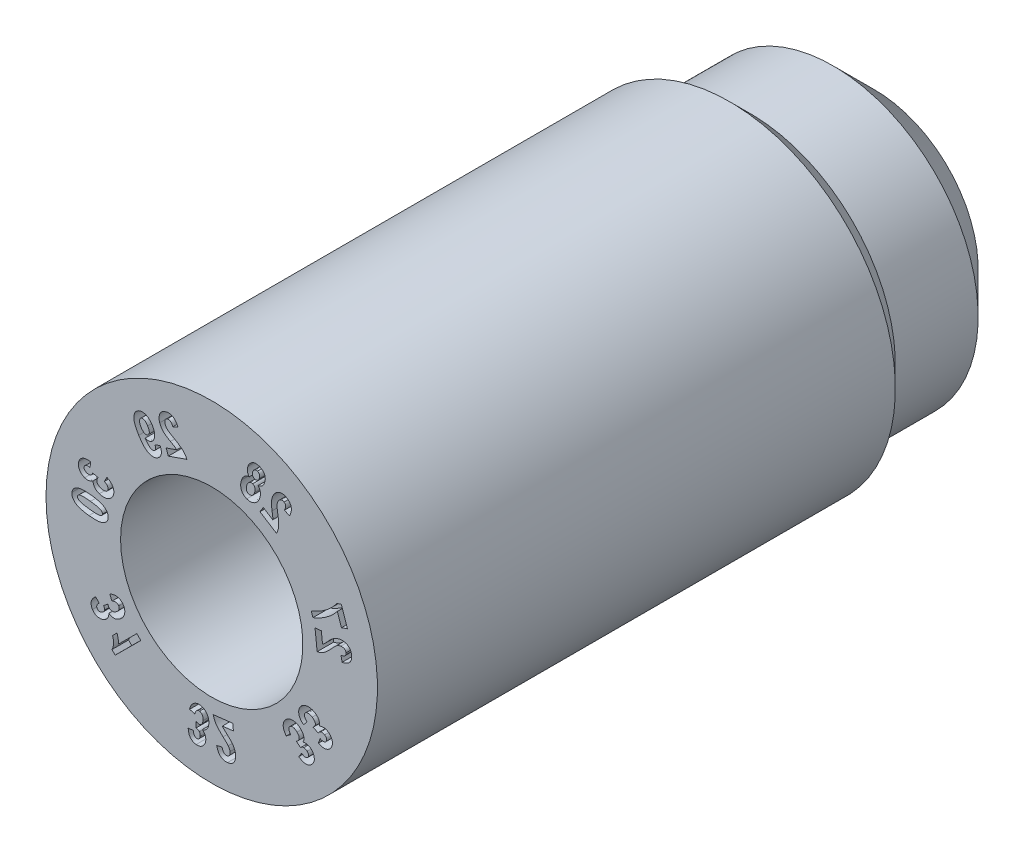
from build123d import *

# Parameters (mm, degrees)
CUT_EXTRUDE1_DEPTH = 0.2


with BuildPart() as part:
    # Sketch2 → Revolve1 (revolve)
    with BuildSketch(Plane(origin=(0, 0, 0), x_dir=(1, 0, 0), z_dir=(0, 1, 0)), mode=Mode.PRIVATE) as revolve1_sk:
        Polygon((1.249621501, 7.999984), (0.75, 7.999984), (0.75, 5.499984), (1.1, 5.499984), (1.1, 0), (2, 0), (2, 6.250367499), (1.7500005, 6.500366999), (1.7500005, 7.499605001), align=None)
    revolve(revolve1_sk.sketch.rotate(Axis((0, 0, -4.849143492), (0, 0, 1)), 180), axis=Axis((0, 0, -4.849143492), (0, 0, 1)))

    # Sketch9 → Cut-Extrude1 (cut)
    # profile 1 of 14: a face of its own
    with BuildSketch(Plane.XY):
        with BuildLine():
            Line((1.323109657, 0.256165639), (1.246917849, 0.248032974))
            Line((1.246917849, 0.248032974), (1.272091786, 0.012214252))
            add(Edge.make_bspline(
                [(1.272091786, 0.012214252), (1.279142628, 0.013775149), (1.293208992, 0.016889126), (1.313531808, 0.024167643), (1.333191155, 0.03306958), (1.349016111, 0.042223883), (1.361660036, 0.050945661), (1.371909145, 0.05862367), (1.382677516, 0.067645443), (1.394158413, 0.077815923), (1.406144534, 0.089360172), (1.418982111, 0.101904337), (1.432268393, 0.115873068), (1.441282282, 0.12563537), (1.445945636, 0.130685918)],
                knots=[0, 0, 0, 0, 1.210903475, 2.415741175, 3.614422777, 4.829304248, 5.477408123, 6.191639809, 6.977581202, 7.834306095, 8.765204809, 9.770030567, 10.846320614, 12, 12, 12, 12], degree=3))
            add(Edge.make_bspline(
                [(1.445945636, 0.130685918), (1.449599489, 0.134648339), (1.456573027, 0.142210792), (1.466667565, 0.152884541), (1.475792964, 0.162422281), (1.484176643, 0.170640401), (1.491427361, 0.177876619), (1.497856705, 0.183874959), (1.503371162, 0.1886952), (1.506888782, 0.19135871), (1.508455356, 0.192544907)],
                knots=[0, 0, 0, 0, 1.469359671, 2.804336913, 4.005076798, 5.067497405, 6.004650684, 6.797449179, 7.46444311, 8, 8, 8, 8], degree=3))
            add(Edge.make_bspline(
                [(1.508455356, 0.192544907), (1.512477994, 0.195334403), (1.520320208, 0.200772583), (1.532993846, 0.206909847), (1.545871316, 0.211280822), (1.554679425, 0.212638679), (1.559029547, 0.213309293)],
                knots=[0, 0, 0, 0, 1.061115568, 2.068666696, 3.046158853, 4, 4, 4, 4], degree=3))
            add(Edge.make_bspline(
                [(1.559029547, 0.213309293), (1.56344589, 0.213673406), (1.571774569, 0.214360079), (1.583617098, 0.213140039), (1.593989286, 0.210333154), (1.602755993, 0.205601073), (1.609909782, 0.199437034), (1.615301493, 0.1919207), (1.619059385, 0.183279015), (1.620027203, 0.176992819), (1.620524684, 0.173761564)],
                knots=[0, 0, 0, 0, 1.284830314, 2.42303217, 3.43989917, 4.386563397, 5.292301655, 6.158766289, 7.053562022, 8, 8, 8, 8], degree=3))
            add(Edge.make_bspline(
                [(1.620524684, 0.173761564), (1.620716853, 0.170218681), (1.621086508, 0.163403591), (1.61893973, 0.153504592), (1.614324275, 0.144775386), (1.607559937, 0.137114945), (1.598489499, 0.13066965), (1.587206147, 0.125522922), (1.573833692, 0.121141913), (1.564040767, 0.119365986), (1.558826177, 0.118420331)],
                knots=[0, 0, 0, 0, 0.913722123, 1.757635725, 2.579276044, 3.438933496, 4.37433614, 5.431505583, 6.632314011, 8, 8, 8, 8], degree=3))
            Line((1.558826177, 0.118420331), (1.574173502, 0.052554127))
            add(Edge.make_bspline(
                [(1.574173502, 0.052554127), (1.579376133, 0.05368409), (1.589480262, 0.055878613), (1.603966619, 0.060084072), (1.617254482, 0.065055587), (1.629433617, 0.070507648), (1.640407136, 0.076663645), (1.650235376, 0.083419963), (1.658882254, 0.090876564), (1.666368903, 0.098961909), (1.672726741, 0.10764362), (1.678121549, 0.116814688), (1.682459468, 0.126530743), (1.685651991, 0.136801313), (1.688029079, 0.147531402), (1.68919392, 0.158818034), (1.689302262, 0.170632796), (1.688650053, 0.17863574), (1.688315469, 0.182741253)],
                knots=[0, 0, 0, 0, 1.316678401, 2.557146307, 3.727226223, 4.823655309, 5.854584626, 6.835260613, 7.768888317, 8.673026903, 9.554907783, 10.425565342, 11.300463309, 12.180346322, 13.081818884, 14.014614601, 14.981496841, 16, 16, 16, 16], degree=3))
            add(Edge.make_bspline(
                [(1.688315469, 0.182741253), (1.687720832, 0.187191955), (1.686567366, 0.195825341), (1.683627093, 0.208266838), (1.679518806, 0.219666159), (1.6744869, 0.230197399), (1.668277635, 0.239647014), (1.661116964, 0.248245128), (1.65279497, 0.255737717), (1.643598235, 0.262248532), (1.633822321, 0.267854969), (1.623694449, 0.272510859), (1.613339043, 0.276273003), (1.602778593, 0.279192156), (1.591965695, 0.281085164), (1.580932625, 0.282219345), (1.56966018, 0.282362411), (1.562103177, 0.281709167), (1.558294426, 0.28137993)],
                knots=[0, 0, 0, 0, 1.173652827, 2.276629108, 3.335023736, 4.336619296, 5.321091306, 6.283820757, 7.254537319, 8.239831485, 9.225125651, 10.197062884, 11.150738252, 12.103199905, 13.057936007, 14.017536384, 15.000832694, 16, 16, 16, 16], degree=3))
            add(Edge.make_bspline(
                [(1.558294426, 0.28137993), (1.553952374, 0.280830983), (1.545308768, 0.27973821), (1.532611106, 0.276899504), (1.520182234, 0.273298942), (1.508004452, 0.268881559), (1.496038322, 0.263447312), (1.48418056, 0.257094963), (1.472368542, 0.24975455), (1.462565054, 0.242867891), (1.454571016, 0.236659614), (1.448234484, 0.231187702), (1.441483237, 0.225111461), (1.434380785, 0.21833914), (1.426851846, 0.211019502), (1.419051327, 0.202904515), (1.410809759, 0.194196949), (1.40525611, 0.188090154), (1.402405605, 0.184955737)],
                knots=[0, 0, 0, 0, 1.116805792, 2.223195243, 3.31725657, 4.418851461, 5.527133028, 6.669491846, 7.850789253, 9.075422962, 9.72636706, 10.433968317, 11.212223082, 12.045064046, 12.93920453, 13.892729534, 14.918407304, 16, 16, 16, 16], degree=3))
            add(Edge.make_bspline(
                [(1.402405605, 0.184955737), (1.399765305, 0.182055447), (1.394734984, 0.176529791), (1.387530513, 0.168684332), (1.380931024, 0.16175445), (1.375258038, 0.155427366), (1.370014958, 0.15018294), (1.36568106, 0.145574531), (1.361908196, 0.141928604), (1.356292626, 0.136528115), (1.34846161, 0.129730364), (1.340947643, 0.124872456), (1.337338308, 0.122538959)],
                knots=[0, 0, 0, 0, 1.30077431, 2.478245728, 3.532467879, 4.474445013, 5.295791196, 5.991390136, 6.572169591, 7.035389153, 8.575948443, 10, 10, 10, 10], degree=3))
            Line((1.337338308, 0.122538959), (1.323109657, 0.256165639))
        make_face()
    # profile 2 of 14: a face of its own
    with BuildSketch(Plane.XY):
        with BuildLine():
            Line((1.565521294, 0.409472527), (1.638048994, 0.434197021))
            Line((1.638048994, 0.434197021), (1.563510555, 0.653259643))
            Line((1.563510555, 0.653259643), (1.506823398, 0.633976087))
            add(Edge.make_bspline(
                [(1.506823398, 0.633976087), (1.504771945, 0.630744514), (1.500520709, 0.62404771), (1.493318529, 0.614115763), (1.48535194, 0.603804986), (1.476528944, 0.59320906), (1.466855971, 0.582292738), (1.456383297, 0.571048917), (1.444940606, 0.559600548), (1.428715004, 0.543690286), (1.406936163, 0.524226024), (1.379305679, 0.501865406), (1.349944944, 0.480847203), (1.324395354, 0.464459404), (1.303543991, 0.452116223), (1.288065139, 0.443419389), (1.272794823, 0.435383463), (1.257816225, 0.427762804), (1.242972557, 0.420956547), (1.228432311, 0.414575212), (1.214083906, 0.408972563), (1.204541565, 0.405595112), (1.199850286, 0.403934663)],
                knots=[0, 0, 0, 0, 0.589391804, 1.22139965, 1.888530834, 2.595967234, 3.344460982, 4.134646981, 4.962011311, 5.837122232, 7.634299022, 9.458009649, 11.308963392, 13.192414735, 14.13085863, 15.040563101, 15.926487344, 16.788336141, 17.628408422, 18.441066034, 19.23358484, 20, 20, 20, 20], degree=3))
            Line((1.199850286, 0.403934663), (1.2208451, 0.342292))
            add(Edge.make_bspline(
                [(1.2208451, 0.342292), (1.227996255, 0.344981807), (1.24230587, 0.350364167), (1.263347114, 0.359584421), (1.2842092, 0.369365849), (1.304760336, 0.379974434), (1.325036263, 0.391372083), (1.345104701, 0.403396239), (1.364791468, 0.416382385), (1.384225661, 0.429912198), (1.403104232, 0.444125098), (1.421475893, 0.458670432), (1.43895917, 0.47379022), (1.455788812, 0.489235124), (1.471998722, 0.50499869), (1.487324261, 0.521332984), (1.502074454, 0.537954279), (1.511303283, 0.549440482), (1.51590831, 0.555171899)],
                knots=[0, 0, 0, 0, 0.995711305, 1.992439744, 2.993334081, 3.998741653, 5.006170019, 6.02477866, 7.047414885, 8.079612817, 9.110870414, 10.127077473, 11.133342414, 12.122892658, 13.104282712, 14.079701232, 15.041804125, 16, 16, 16, 16], degree=3))
            Line((1.51590831, 0.555171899), (1.565521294, 0.409472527))
        make_face()
    # profile 3 of 14: a face of its own
    with BuildSketch(Plane.XY):
        with BuildLine():
            Line((0.623027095, 1.194741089), (0.582032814, 1.130041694))
            Line((0.582032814, 1.130041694), (0.782447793, 1.003099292))
            add(Edge.make_bspline(
                [(0.782447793, 1.003099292), (0.78560036, 1.009585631), (0.791893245, 1.022533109), (0.798840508, 1.042950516), (0.804034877, 1.063897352), (0.806778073, 1.081950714), (0.807874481, 1.097304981), (0.808106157, 1.110128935), (0.807818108, 1.124223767), (0.806868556, 1.139530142), (0.805538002, 1.156122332), (0.803493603, 1.173948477), (0.800924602, 1.193050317), (0.79889467, 1.206170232), (0.79784506, 1.212954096)],
                knots=[0, 0, 0, 0, 1.209246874, 2.413795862, 3.610606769, 4.827600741, 5.472357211, 6.192679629, 6.979167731, 7.837494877, 8.765798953, 9.772183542, 10.84807132, 12, 12, 12, 12], degree=3))
            add(Edge.make_bspline(
                [(0.79784506, 1.212954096), (0.797035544, 1.218266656), (0.795488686, 1.228418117), (0.793260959, 1.242923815), (0.791647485, 1.256054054), (0.790227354, 1.267695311), (0.789172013, 1.277891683), (0.788480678, 1.286623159), (0.788147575, 1.29396222), (0.788259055, 1.298375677), (0.788308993, 1.30035271)],
                knots=[0, 0, 0, 0, 1.465397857, 2.800143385, 4.001523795, 5.072464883, 5.998102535, 6.796435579, 7.460856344, 8, 8, 8, 8], degree=3))
            add(Edge.make_bspline(
                [(0.788308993, 1.30035271), (0.788646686, 1.305249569), (0.789304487, 1.31478828), (0.792237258, 1.328559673), (0.796833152, 1.341368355), (0.801276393, 1.349088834), (0.803479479, 1.352916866)],
                knots=[0, 0, 0, 0, 1.063374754, 2.071373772, 3.043732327, 4, 4, 4, 4], degree=3))
            add(Edge.make_bspline(
                [(0.803479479, 1.352916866), (0.805968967, 1.356565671), (0.810670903, 1.363457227), (0.8188214, 1.372108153), (0.827524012, 1.37840354), (0.836625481, 1.382350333), (0.845888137, 1.384134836), (0.855113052, 1.383717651), (0.864208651, 1.381240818), (0.869721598, 1.378087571), (0.872558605, 1.376464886)],
                knots=[0, 0, 0, 0, 1.283710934, 2.424565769, 3.438678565, 4.38694039, 5.287892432, 6.158412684, 7.052304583, 8, 8, 8, 8], degree=3))
            add(Edge.make_bspline(
                [(0.872558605, 1.376464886), (0.875479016, 1.37441821), (0.881079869, 1.370493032), (0.887405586, 1.362555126), (0.891477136, 1.353563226), (0.893189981, 1.3434696), (0.892577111, 1.332400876), (0.889815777, 1.320316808), (0.884780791, 1.307205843), (0.880109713, 1.298454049), (0.877628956, 1.293806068)],
                knots=[0, 0, 0, 0, 0.918133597, 1.760824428, 2.588175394, 3.445602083, 4.380762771, 5.43671857, 6.638669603, 8, 8, 8, 8], degree=3))
            Line((0.877628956, 1.293806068), (0.93879659, 1.264752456))
            add(Edge.make_bspline(
                [(0.93879659, 1.264752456), (0.941147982, 1.269541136), (0.945713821, 1.278839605), (0.951318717, 1.292836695), (0.955884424, 1.306250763), (0.959040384, 1.319226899), (0.961120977, 1.331652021), (0.961941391, 1.343592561), (0.961365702, 1.354982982), (0.959746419, 1.365884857), (0.956953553, 1.376288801), (0.95303656, 1.386193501), (0.948039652, 1.395592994), (0.94221439, 1.404652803), (0.935009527, 1.412992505), (0.926987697, 1.421001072), (0.917902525, 1.428564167), (0.911198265, 1.432978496), (0.907767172, 1.435237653)],
                knots=[0, 0, 0, 0, 1.318411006, 2.560038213, 3.724635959, 4.818425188, 5.857553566, 6.836000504, 7.770750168, 8.671587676, 9.555887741, 10.427823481, 11.298602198, 12.184304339, 13.084251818, 14.016786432, 14.98503485, 16, 16, 16, 16], degree=3))
            add(Edge.make_bspline(
                [(0.907767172, 1.435237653), (0.903914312, 1.437556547), (0.896450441, 1.442048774), (0.884827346, 1.447373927), (0.873346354, 1.451328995), (0.861948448, 1.453817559), (0.850679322, 1.454965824), (0.839513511, 1.454624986), (0.828462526, 1.452767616), (0.817660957, 1.449635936), (0.807213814, 1.445410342), (0.79722791, 1.440433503), (0.787903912, 1.434590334), (0.77899711, 1.428225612), (0.77081365, 1.420886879), (0.763066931, 1.412909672), (0.75598214, 1.404108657), (0.751773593, 1.397804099), (0.749645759, 1.394616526)],
                knots=[0, 0, 0, 0, 1.174566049, 2.275403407, 3.3344755, 4.342584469, 5.317767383, 6.288019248, 7.252865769, 8.238921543, 9.22145463, 10.194769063, 11.150951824, 12.094724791, 13.052266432, 14.019416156, 14.99862046, 16, 16, 16, 16], degree=3))
            add(Edge.make_bspline(
                [(0.749645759, 1.394616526), (0.747392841, 1.390867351), (0.742909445, 1.383406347), (0.737137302, 1.371758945), (0.732202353, 1.359817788), (0.728146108, 1.347536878), (0.724944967, 1.33480572), (0.722498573, 1.321575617), (0.720969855, 1.307744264), (0.720248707, 1.295781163), (0.720205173, 1.285626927), (0.720420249, 1.277265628), (0.720920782, 1.268178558), (0.721860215, 1.258409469), (0.722935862, 1.247931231), (0.724342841, 1.236757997), (0.726152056, 1.224905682), (0.727456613, 1.216754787), (0.728127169, 1.212565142)],
                knots=[0, 0, 0, 0, 1.116151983, 2.22118634, 3.314410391, 4.411936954, 5.519387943, 6.662957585, 7.843432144, 9.069374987, 9.720225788, 10.434857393, 11.204166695, 12.042726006, 12.939692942, 13.892907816, 14.916932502, 16, 16, 16, 16], degree=3))
            add(Edge.make_bspline(
                [(0.728127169, 1.212565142), (0.728774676, 1.208715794), (0.730011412, 1.201363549), (0.731558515, 1.190836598), (0.73307722, 1.18142475), (0.734310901, 1.173031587), (0.735338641, 1.165687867), (0.736052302, 1.159363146), (0.736761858, 1.154146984), (0.737347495, 1.146346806), (0.737758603, 1.135984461), (0.736946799, 1.127066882), (0.736559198, 1.122809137)],
                knots=[0, 0, 0, 0, 1.294749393, 2.47296814, 3.529216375, 4.457012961, 5.286949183, 5.988657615, 6.568329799, 7.032428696, 8.583117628, 10, 10, 10, 10], degree=3))
            Line((0.736559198, 1.122809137), (0.623027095, 1.194741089))
        make_face()
    # profile 4 of 14: a face of its own
    with BuildSketch(Plane.XY):
        with BuildLine():
            add(Edge.make_bspline(
                [(0.559836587, 1.392490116), (0.564370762, 1.393245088), (0.57323795, 1.394721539), (0.585779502, 1.399258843), (0.597334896, 1.405176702), (0.607780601, 1.412873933), (0.617020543, 1.422263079), (0.625194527, 1.43320857), (0.632208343, 1.445776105), (0.635802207, 1.454932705), (0.637656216, 1.459656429)],
                knots=[0, 0, 0, 0, 1.013170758, 1.981391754, 2.931006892, 3.871893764, 4.833101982, 5.82964644, 6.880353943, 8, 8, 8, 8], degree=3))
            add(Edge.make_bspline(
                [(0.637656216, 1.459656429), (0.638984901, 1.463604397), (0.641575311, 1.471301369), (0.644327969, 1.482906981), (0.645865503, 1.494236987), (0.646546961, 1.505243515), (0.64596596, 1.515952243), (0.644436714, 1.526318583), (0.641746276, 1.536383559), (0.638035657, 1.546087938), (0.633270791, 1.555288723), (0.627668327, 1.563922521), (0.621061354, 1.571803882), (0.613639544, 1.579072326), (0.605231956, 1.585616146), (0.595906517, 1.591415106), (0.585714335, 1.596656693), (0.578450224, 1.599442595), (0.574720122, 1.600873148)],
                knots=[0, 0, 0, 0, 1.144769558, 2.23184656, 3.2726845, 4.284999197, 5.25851954, 6.215380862, 7.160680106, 8.116739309, 9.065852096, 10.004091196, 10.940283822, 11.887171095, 12.854961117, 13.862591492, 14.902446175, 16, 16, 16, 16], degree=3))
            add(Edge.make_bspline(
                [(0.574720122, 1.600873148), (0.570733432, 1.602207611), (0.562970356, 1.604806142), (0.551278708, 1.607399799), (0.539949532, 1.608735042), (0.529004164, 1.608959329), (0.518419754, 1.607897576), (0.508295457, 1.605466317), (0.498459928, 1.602101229), (0.489215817, 1.597253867), (0.480404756, 1.591646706), (0.472212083, 1.585253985), (0.464683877, 1.578171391), (0.457820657, 1.570386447), (0.451661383, 1.561852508), (0.445993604, 1.55269811), (0.441149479, 1.542756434), (0.438458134, 1.535800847), (0.437093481, 1.532273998)],
                knots=[0, 0, 0, 0, 1.162778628, 2.264218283, 3.306833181, 4.314922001, 5.288125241, 6.241116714, 7.190771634, 8.156725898, 9.121371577, 10.078162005, 11.027544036, 11.97781267, 12.945274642, 13.936678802, 14.953787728, 16, 16, 16, 16], degree=3))
            add(Edge.make_bspline(
                [(0.437093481, 1.532273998), (0.435501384, 1.527411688), (0.432407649, 1.517963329), (0.429984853, 1.503555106), (0.429323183, 1.489615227), (0.430749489, 1.476214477), (0.433722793, 1.46349399), (0.438487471, 1.451652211), (0.444682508, 1.440585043), (0.450050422, 1.434099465), (0.452754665, 1.430832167)],
                knots=[0, 0, 0, 0, 1.136066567, 2.207585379, 3.237012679, 4.229211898, 5.193977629, 6.131666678, 7.058772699, 8, 8, 8, 8], degree=3))
            add(Edge.make_bspline(
                [(0.452754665, 1.430832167), (0.447355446, 1.430060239), (0.436771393, 1.428547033), (0.421761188, 1.423516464), (0.408039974, 1.416480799), (0.395605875, 1.407372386), (0.384621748, 1.396053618), (0.374751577, 1.382840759), (0.366392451, 1.367390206), (0.361975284, 1.356163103), (0.359683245, 1.350337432)],
                knots=[0, 0, 0, 0, 1.001034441, 1.962321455, 2.89402004, 3.826470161, 4.782089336, 5.783152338, 6.849692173, 8, 8, 8, 8], degree=3))
            add(Edge.make_bspline(
                [(0.359683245, 1.350337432), (0.357624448, 1.344156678), (0.353618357, 1.332129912), (0.350148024, 1.313805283), (0.348721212, 1.295997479), (0.349427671, 1.278756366), (0.352283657, 1.262399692), (0.356908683, 1.2470517), (0.363793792, 1.233019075), (0.372380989, 1.22021824), (0.382838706, 1.208978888), (0.394671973, 1.199189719), (0.408096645, 1.191104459), (0.417862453, 1.187203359), (0.422843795, 1.185213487)],
                knots=[0, 0, 0, 0, 1.181329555, 2.298679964, 3.375137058, 4.418128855, 5.421336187, 6.381853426, 7.317278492, 8.247684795, 9.169726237, 10.093579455, 11.02757334, 12, 12, 12, 12], degree=3))
            add(Edge.make_bspline(
                [(0.422843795, 1.185213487), (0.426804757, 1.183881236), (0.434604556, 1.181257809), (0.446553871, 1.178903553), (0.458331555, 1.177568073), (0.469979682, 1.177497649), (0.481449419, 1.178781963), (0.49279805, 1.181170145), (0.503962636, 1.184893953), (0.514904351, 1.189820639), (0.525430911, 1.195862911), (0.53522766, 1.203180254), (0.5444205, 1.211381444), (0.552804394, 1.220778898), (0.560349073, 1.231315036), (0.56734915, 1.242807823), (0.573511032, 1.255452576), (0.57694346, 1.264394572), (0.578704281, 1.268981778)],
                knots=[0, 0, 0, 0, 1.007412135, 1.983763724, 2.931729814, 3.864506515, 4.787596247, 5.711565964, 6.657841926, 7.621397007, 8.602981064, 9.58001345, 10.566602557, 11.571076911, 12.611677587, 13.689547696, 14.814747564, 16, 16, 16, 16], degree=3))
            add(Edge.make_bspline(
                [(0.578704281, 1.268981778), (0.580663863, 1.274946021), (0.584466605, 1.28652016), (0.587573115, 1.304072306), (0.588566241, 1.320968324), (0.58725845, 1.33720344), (0.58374009, 1.352623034), (0.57796716, 1.367067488), (0.570163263, 1.380612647), (0.563309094, 1.388496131), (0.559836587, 1.392490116)],
                knots=[0, 0, 0, 0, 1.141665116, 2.21550199, 3.234288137, 4.215348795, 5.170622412, 6.102000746, 7.03842252, 8, 8, 8, 8], degree=3))
        make_face()
        with BuildLine():
            add(Edge.make_bspline(
                [(0.575085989, 1.475745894), (0.573617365, 1.472022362), (0.570833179, 1.464963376), (0.565076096, 1.455754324), (0.558537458, 1.448251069), (0.550935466, 1.442920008), (0.54282508, 1.439479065), (0.534474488, 1.437794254), (0.525878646, 1.438081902), (0.520392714, 1.439723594), (0.517579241, 1.440565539)],
                knots=[0, 0, 0, 0, 1.264918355, 2.398003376, 3.421208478, 4.395246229, 5.309650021, 6.192775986, 7.073161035, 8, 8, 8, 8], degree=3))
            add(Edge.make_bspline(
                [(0.517579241, 1.440565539), (0.514833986, 1.441720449), (0.509451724, 1.44398473), (0.502506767, 1.449244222), (0.49703689, 1.455916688), (0.492884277, 1.463730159), (0.490456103, 1.472766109), (0.490024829, 1.48272353), (0.491446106, 1.493522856), (0.49379649, 1.500715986), (0.495037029, 1.50451254)],
                knots=[0, 0, 0, 0, 0.934148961, 1.83146372, 2.707062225, 3.629671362, 4.594279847, 5.623859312, 6.745866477, 8, 8, 8, 8], degree=3))
            add(Edge.make_bspline(
                [(0.495037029, 1.50451254), (0.49645342, 1.508128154), (0.49914483, 1.514998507), (0.504808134, 1.523955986), (0.511324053, 1.531249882), (0.518889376, 1.536472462), (0.526868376, 1.540082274), (0.53518303, 1.541711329), (0.543683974, 1.541510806), (0.549130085, 1.539900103), (0.551922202, 1.539074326)],
                knots=[0, 0, 0, 0, 1.245332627, 2.366368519, 3.386680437, 4.366282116, 5.298406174, 6.181589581, 7.067735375, 8, 8, 8, 8], degree=3))
            add(Edge.make_bspline(
                [(0.551922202, 1.539074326), (0.554742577, 1.53792179), (0.560214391, 1.535685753), (0.567138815, 1.530209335), (0.572748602, 1.523568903), (0.576804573, 1.51561395), (0.579216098, 1.506669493), (0.579809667, 1.496893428), (0.578459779, 1.48640264), (0.576247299, 1.479414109), (0.575085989, 1.475745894)],
                knots=[0, 0, 0, 0, 0.96120977, 1.864844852, 2.765042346, 3.698091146, 4.669847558, 5.680510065, 6.782521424, 8, 8, 8, 8], degree=3))
        make_face(mode=Mode.SUBTRACT)
        with BuildLine():
            add(Edge.make_bspline(
                [(0.518231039, 1.299162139), (0.517229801, 1.296531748), (0.515274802, 1.291395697), (0.512020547, 1.284063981), (0.508324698, 1.27745201), (0.504566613, 1.271347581), (0.500332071, 1.266014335), (0.495961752, 1.261175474), (0.491285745, 1.25698703), (0.484854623, 1.252403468), (0.476566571, 1.24818256), (0.466404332, 1.245208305), (0.456149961, 1.244870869), (0.449736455, 1.246722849), (0.446508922, 1.24765484)],
                knots=[0, 0, 0, 0, 1.030241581, 2.01163057, 2.9324791, 3.801395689, 4.632098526, 5.421092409, 6.186014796, 6.9246267, 8.307242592, 9.568441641, 10.77634277, 12, 12, 12, 12], degree=3))
            add(Edge.make_bspline(
                [(0.446508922, 1.24765484), (0.443428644, 1.24899391), (0.437374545, 1.251625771), (0.429710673, 1.258140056), (0.42377042, 1.266473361), (0.420244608, 1.274675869), (0.418284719, 1.281977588), (0.417508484, 1.28801693), (0.417187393, 1.294415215), (0.417465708, 1.301208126), (0.418397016, 1.308387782), (0.420008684, 1.315936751), (0.422114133, 1.323878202), (0.423950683, 1.329220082), (0.424894, 1.331963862)],
                knots=[0, 0, 0, 0, 1.236568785, 2.430400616, 3.664253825, 4.991764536, 5.708150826, 6.454041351, 7.238257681, 8.074992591, 8.964201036, 9.911906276, 10.927481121, 12, 12, 12, 12], degree=3))
            add(Edge.make_bspline(
                [(0.424894, 1.331963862), (0.426702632, 1.336531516), (0.43015803, 1.345258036), (0.437141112, 1.356860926), (0.445275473, 1.36638417), (0.454558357, 1.373496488), (0.464348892, 1.378450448), (0.474395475, 1.381097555), (0.484589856, 1.381201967), (0.491008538, 1.379345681), (0.494258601, 1.378405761)],
                knots=[0, 0, 0, 0, 1.264714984, 2.416242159, 3.473844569, 4.474163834, 5.41053745, 6.284816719, 7.131526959, 8, 8, 8, 8], degree=3))
            add(Edge.make_bspline(
                [(0.494258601, 1.378405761), (0.497346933, 1.37707554), (0.503417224, 1.374460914), (0.511007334, 1.367780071), (0.517112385, 1.359422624), (0.521408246, 1.349266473), (0.524019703, 1.33791037), (0.524408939, 1.325547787), (0.522490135, 1.312435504), (0.51969375, 1.30372064), (0.518231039, 1.299162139)],
                knots=[0, 0, 0, 0, 0.8714725, 1.712928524, 2.597162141, 3.54967375, 4.565433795, 5.617859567, 6.753969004, 8, 8, 8, 8], degree=3))
        make_face(mode=Mode.SUBTRACT)
    # profile 5 of 14: a face of its own
    with BuildSketch(Plane.XY):
        with BuildLine():
            Line((-0.549755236, 1.230478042), (-0.524442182, 1.157883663))
            Line((-0.524442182, 1.157883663), (-0.299849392, 1.236331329))
            add(Edge.make_bspline(
                [(-0.299849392, 1.236331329), (-0.302989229, 1.242866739), (-0.309234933, 1.255866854), (-0.320963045, 1.274057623), (-0.33408634, 1.291258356), (-0.346584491, 1.304692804), (-0.357979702, 1.315063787), (-0.367862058, 1.323282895), (-0.379111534, 1.33181885), (-0.391751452, 1.34062547), (-0.405656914, 1.349889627), (-0.420949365, 1.359415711), (-0.437530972, 1.369376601), (-0.449129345, 1.375939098), (-0.455127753, 1.37933307)],
                knots=[0, 0, 0, 0, 1.211711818, 2.410314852, 3.612112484, 4.827383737, 5.472827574, 6.188420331, 6.976615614, 7.834018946, 8.764800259, 9.77110216, 10.84726594, 12, 12, 12, 12], degree=3))
            add(Edge.make_bspline(
                [(-0.455127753, 1.37933307), (-0.45984378, 1.381966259), (-0.468837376, 1.386987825), (-0.481514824, 1.394467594), (-0.492921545, 1.401202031), (-0.502938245, 1.407365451), (-0.511577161, 1.412928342), (-0.518936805, 1.417733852), (-0.52485804, 1.422086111), (-0.528276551, 1.424872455), (-0.529802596, 1.426116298)],
                knots=[0, 0, 0, 0, 1.469497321, 2.802373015, 4.004576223, 5.073463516, 6.001891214, 6.800198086, 7.464400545, 8, 8, 8, 8], degree=3))
            add(Edge.make_bspline(
                [(-0.529802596, 1.426116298), (-0.53346133, 1.429435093), (-0.540572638, 1.43588568), (-0.54941366, 1.446914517), (-0.556789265, 1.458412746), (-0.560051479, 1.466758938), (-0.561668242, 1.470895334)],
                knots=[0, 0, 0, 0, 1.064830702, 2.069661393, 3.043318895, 4, 4, 4, 4], degree=3))
            add(Edge.make_bspline(
                [(-0.561668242, 1.470895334), (-0.563028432, 1.47512306), (-0.565592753, 1.483093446), (-0.567238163, 1.494927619), (-0.566836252, 1.505714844), (-0.564155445, 1.515307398), (-0.559704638, 1.523625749), (-0.553749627, 1.530672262), (-0.546099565, 1.536273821), (-0.540204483, 1.538682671), (-0.537146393, 1.539932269)],
                knots=[0, 0, 0, 0, 1.285253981, 2.423045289, 3.44445975, 4.39210584, 5.283170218, 6.159396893, 7.045182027, 8, 8, 8, 8], degree=3))
            add(Edge.make_bspline(
                [(-0.537146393, 1.539932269), (-0.533727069, 1.54095569), (-0.527138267, 1.542927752), (-0.516959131, 1.542909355), (-0.507338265, 1.540560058), (-0.498354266, 1.535593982), (-0.490026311, 1.528204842), (-0.482323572, 1.518420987), (-0.475121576, 1.50629301), (-0.47114449, 1.49715032), (-0.469029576, 1.492288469)],
                knots=[0, 0, 0, 0, 0.914941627, 1.763029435, 2.585494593, 3.441122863, 4.378356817, 5.434468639, 6.635715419, 8, 8, 8, 8], degree=3))
            Line((-0.469029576, 1.492288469), (-0.408122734, 1.522361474))
            add(Edge.make_bspline(
                [(-0.408122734, 1.522361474), (-0.410431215, 1.527197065), (-0.414909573, 1.536577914), (-0.422362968, 1.549717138), (-0.430052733, 1.561655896), (-0.438235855, 1.572225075), (-0.446715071, 1.581610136), (-0.455625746, 1.589618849), (-0.464887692, 1.596341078), (-0.474464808, 1.601853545), (-0.484463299, 1.606005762), (-0.494650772, 1.609208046), (-0.505168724, 1.611255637), (-0.515945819, 1.611987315), (-0.52700085, 1.611785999), (-0.53828857, 1.610382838), (-0.549855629, 1.607820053), (-0.557513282, 1.605353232), (-0.561442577, 1.604087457)],
                knots=[0, 0, 0, 0, 1.320291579, 2.561311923, 3.720457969, 4.817350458, 5.852117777, 6.833826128, 7.764367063, 8.668238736, 9.550445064, 10.427305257, 11.296601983, 12.184382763, 13.084779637, 14.017940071, 14.982965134, 16, 16, 16, 16], degree=3))
            add(Edge.make_bspline(
                [(-0.561442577, 1.604087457), (-0.565664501, 1.602521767), (-0.573868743, 1.599479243), (-0.585253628, 1.593620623), (-0.595545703, 1.587128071), (-0.604576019, 1.57971053), (-0.612507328, 1.571580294), (-0.619143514, 1.562563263), (-0.624686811, 1.55281182), (-0.628851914, 1.542317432), (-0.631940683, 1.531489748), (-0.634334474, 1.52057884), (-0.635592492, 1.509608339), (-0.636126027, 1.498603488), (-0.635454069, 1.487593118), (-0.633996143, 1.476533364), (-0.631576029, 1.465456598), (-0.629207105, 1.458204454), (-0.628014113, 1.45455227)],
                knots=[0, 0, 0, 0, 1.172755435, 2.278953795, 3.330546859, 4.338977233, 5.317908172, 6.283389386, 7.24916821, 8.233719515, 9.218154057, 10.182056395, 11.141655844, 12.093074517, 13.050185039, 14.012326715, 14.99900653, 16, 16, 16, 16], degree=3))
            add(Edge.make_bspline(
                [(-0.628014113, 1.45455227), (-0.626497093, 1.450432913), (-0.623482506, 1.442247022), (-0.61787922, 1.430443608), (-0.611472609, 1.419177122), (-0.60432532, 1.408327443), (-0.596371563, 1.397850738), (-0.587389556, 1.387755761), (-0.577558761, 1.377838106), (-0.568492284, 1.369919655), (-0.560634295, 1.363445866), (-0.553834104, 1.358525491), (-0.546479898, 1.353204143), (-0.538223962, 1.34788815), (-0.529343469, 1.342205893), (-0.519662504, 1.336388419), (-0.509305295, 1.330343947), (-0.502115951, 1.326323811), (-0.49841523, 1.324254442)],
                knots=[0, 0, 0, 0, 1.117460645, 2.220591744, 3.322653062, 4.415716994, 5.526974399, 6.669175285, 7.854395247, 9.080679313, 9.733033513, 10.446330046, 11.217537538, 12.044361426, 12.946210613, 13.902418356, 14.920267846, 16, 16, 16, 16], degree=3))
            add(Edge.make_bspline(
                [(-0.49841523, 1.324254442), (-0.494995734, 1.3223242), (-0.488452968, 1.318630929), (-0.479084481, 1.313439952), (-0.470712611, 1.308700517), (-0.463387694, 1.304331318), (-0.456957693, 1.300571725), (-0.451453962, 1.297363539), (-0.446991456, 1.294536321), (-0.44046178, 1.290234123), (-0.43214904, 1.283995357), (-0.425619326, 1.277854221), (-0.422482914, 1.274904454)],
                knots=[0, 0, 0, 0, 1.29665562, 2.480984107, 3.536834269, 4.473269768, 5.29730802, 5.996532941, 6.576717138, 7.041424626, 8.578909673, 10, 10, 10, 10], degree=3))
            Line((-0.422482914, 1.274904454), (-0.549755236, 1.230478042))
        make_face()
    # profile 6 of 14: a face of its own
    with BuildSketch(Plane.XY):
        with BuildLine():
            Line((-0.624122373, 1.220656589), (-0.684652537, 1.193367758))
            add(Edge.make_bspline(
                [(-0.684652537, 1.193367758), (-0.683044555, 1.189921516), (-0.680008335, 1.183414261), (-0.676997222, 1.173696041), (-0.675315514, 1.164758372), (-0.675551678, 1.156589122), (-0.677067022, 1.149106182), (-0.680514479, 1.142561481), (-0.685352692, 1.13667547), (-0.689604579, 1.133777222), (-0.691818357, 1.132268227)],
                knots=[0, 0, 0, 0, 1.330739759, 2.512726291, 3.556296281, 4.499970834, 5.360006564, 6.205799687, 7.065835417, 8, 8, 8, 8], degree=3))
            add(Edge.make_bspline(
                [(-0.691818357, 1.132268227), (-0.693428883, 1.131338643), (-0.696610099, 1.129502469), (-0.701790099, 1.12766117), (-0.707106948, 1.126556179), (-0.712627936, 1.126339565), (-0.718307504, 1.126792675), (-0.724123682, 1.128190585), (-0.730157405, 1.130136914), (-0.736403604, 1.133090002), (-0.74310363, 1.137066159), (-0.750104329, 1.142626), (-0.757738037, 1.149548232), (-0.765853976, 1.157993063), (-0.774553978, 1.167900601), (-0.783746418, 1.179276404), (-0.793519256, 1.192133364), (-0.800036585, 1.201307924), (-0.803450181, 1.206113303)],
                knots=[0, 0, 0, 0, 0.607860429, 1.200685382, 1.791287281, 2.379657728, 3.004009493, 3.650841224, 4.333762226, 5.076925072, 5.908243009, 6.879565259, 7.998168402, 9.281482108, 10.71239253, 12.314932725, 14.069864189, 16, 16, 16, 16], degree=3))
            add(Edge.make_bspline(
                [(-0.803450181, 1.206113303), (-0.800124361, 1.204814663), (-0.793646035, 1.202285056), (-0.783807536, 1.199644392), (-0.774191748, 1.198211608), (-0.764813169, 1.197934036), (-0.75568523, 1.198955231), (-0.746734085, 1.2010009), (-0.738036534, 1.204404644), (-0.732581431, 1.207528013), (-0.729826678, 1.209105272)],
                knots=[0, 0, 0, 0, 1.115074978, 2.172041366, 3.175117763, 4.146950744, 5.094947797, 6.037527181, 7.008977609, 8, 8, 8, 8], degree=3))
            add(Edge.make_bspline(
                [(-0.729826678, 1.209105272), (-0.727067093, 1.210976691), (-0.7215915, 1.214689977), (-0.714251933, 1.221399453), (-0.707879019, 1.229020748), (-0.702309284, 1.237438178), (-0.697756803, 1.246781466), (-0.693980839, 1.256956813), (-0.691203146, 1.268045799), (-0.689200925, 1.279854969), (-0.68832247, 1.2921819), (-0.688661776, 1.304802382), (-0.690206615, 1.317578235), (-0.693239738, 1.330476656), (-0.697195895, 1.343598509), (-0.702683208, 1.356807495), (-0.709249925, 1.370222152), (-0.714478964, 1.378964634), (-0.717150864, 1.38343181)],
                knots=[0, 0, 0, 0, 0.825413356, 1.637792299, 2.454093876, 3.28186363, 4.132289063, 5.02368687, 5.96648195, 6.960524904, 7.988374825, 9.023225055, 10.084637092, 11.170815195, 12.302565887, 13.476841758, 14.710733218, 16, 16, 16, 16], degree=3))
            add(Edge.make_bspline(
                [(-0.717150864, 1.38343181), (-0.720144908, 1.388110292), (-0.725986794, 1.397238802), (-0.735676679, 1.409801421), (-0.745739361, 1.421084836), (-0.756193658, 1.431024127), (-0.766959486, 1.439770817), (-0.778198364, 1.44706025), (-0.789795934, 1.453154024), (-0.801760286, 1.457787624), (-0.813765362, 1.46108998), (-0.825599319, 1.463275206), (-0.837206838, 1.464069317), (-0.848580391, 1.463459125), (-0.859735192, 1.461820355), (-0.870590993, 1.458593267), (-0.88124476, 1.454207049), (-0.887940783, 1.450301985), (-0.891338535, 1.448320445)],
                knots=[0, 0, 0, 0, 1.281397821, 2.500223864, 3.656969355, 4.767387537, 5.826017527, 6.85345747, 7.853833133, 8.844432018, 9.808100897, 10.723696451, 11.617502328, 12.48594393, 13.348215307, 14.212913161, 15.093181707, 16, 16, 16, 16], degree=3))
            add(Edge.make_bspline(
                [(-0.891338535, 1.448320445), (-0.89500116, 1.445875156), (-0.902221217, 1.441054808), (-0.911717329, 1.432305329), (-0.919790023, 1.42250436), (-0.926610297, 1.411746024), (-0.932030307, 1.399904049), (-0.936150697, 1.387027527), (-0.938723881, 1.373105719), (-0.940183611, 1.358187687), (-0.939867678, 1.342127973), (-0.937434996, 1.324915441), (-0.932929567, 1.30655307), (-0.926682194, 1.286933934), (-0.918010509, 1.266295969), (-0.907615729, 1.244374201), (-0.895158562, 1.221262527), (-0.885728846, 1.20573664), (-0.880836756, 1.197681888)],
                knots=[0, 0, 0, 0, 0.753724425, 1.485801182, 2.202638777, 2.924173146, 3.662028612, 4.428172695, 5.234622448, 6.083343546, 6.992781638, 7.979715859, 9.055546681, 10.229171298, 11.503915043, 12.887802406, 14.385407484, 16, 16, 16, 16], degree=3))
            add(Edge.make_bspline(
                [(-0.880836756, 1.197681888), (-0.87566931, 1.189593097), (-0.865702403, 1.173991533), (-0.850200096, 1.152181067), (-0.834887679, 1.132707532), (-0.819617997, 1.115657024), (-0.804542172, 1.100885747), (-0.789564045, 1.088518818), (-0.774723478, 1.078492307), (-0.759902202, 1.071011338), (-0.745389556, 1.065461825), (-0.731140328, 1.061707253), (-0.717165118, 1.059732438), (-0.703467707, 1.059561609), (-0.69004883, 1.061011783), (-0.676945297, 1.064420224), (-0.664017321, 1.069306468), (-0.655985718, 1.074006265), (-0.651905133, 1.076394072)],
                knots=[0, 0, 0, 0, 1.587936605, 3.062792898, 4.425441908, 5.684573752, 6.847296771, 7.914254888, 8.894373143, 9.803962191, 10.654881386, 11.460892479, 12.237013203, 12.983923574, 13.72211682, 14.462799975, 15.219000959, 16, 16, 16, 16], degree=3))
            add(Edge.make_bspline(
                [(-0.651905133, 1.076394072), (-0.649174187, 1.078192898), (-0.643800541, 1.081732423), (-0.636424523, 1.087755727), (-0.629878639, 1.09426658), (-0.62413911, 1.101242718), (-0.619293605, 1.108737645), (-0.615134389, 1.11666193), (-0.611893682, 1.125096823), (-0.609327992, 1.133929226), (-0.607794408, 1.143245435), (-0.607160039, 1.153025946), (-0.607591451, 1.163256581), (-0.608999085, 1.173921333), (-0.611336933, 1.185018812), (-0.614598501, 1.196556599), (-0.61883988, 1.208547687), (-0.62232435, 1.216535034), (-0.624122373, 1.220656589)],
                knots=[0, 0, 0, 0, 0.963202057, 1.895279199, 2.800568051, 3.680049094, 4.551811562, 5.426224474, 6.312404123, 7.210114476, 8.132047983, 9.08870681, 10.093566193, 11.14427776, 12.255342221, 13.432665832, 14.675228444, 16, 16, 16, 16], degree=3))
        make_face()
        with BuildLine():
            add(Edge.make_bspline(
                [(-0.850592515, 1.293215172), (-0.852310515, 1.296033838), (-0.855652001, 1.301516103), (-0.859835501, 1.309888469), (-0.863517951, 1.31789375), (-0.866446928, 1.325679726), (-0.868533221, 1.333270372), (-0.86998431, 1.340578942), (-0.870777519, 1.34764254), (-0.870690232, 1.354404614), (-0.870048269, 1.360783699), (-0.868993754, 1.36670463), (-0.867523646, 1.372129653), (-0.86552829, 1.377036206), (-0.862929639, 1.381363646), (-0.860085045, 1.385319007), (-0.856616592, 1.388701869), (-0.853970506, 1.390484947), (-0.852630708, 1.391387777)],
                knots=[0, 0, 0, 0, 1.464437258, 2.848310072, 4.150793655, 5.374512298, 6.535548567, 7.640621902, 8.679228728, 9.683824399, 10.635695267, 11.522302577, 12.350202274, 13.126471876, 13.864104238, 14.585748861, 15.283919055, 16, 16, 16, 16], degree=3))
            add(Edge.make_bspline(
                [(-0.852630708, 1.391387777), (-0.849924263, 1.392806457), (-0.844564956, 1.395615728), (-0.835343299, 1.397051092), (-0.825759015, 1.39605743), (-0.817601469, 1.39348585), (-0.811023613, 1.390090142), (-0.8058917, 1.386626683), (-0.800655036, 1.382374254), (-0.795433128, 1.377194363), (-0.790107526, 1.371223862), (-0.784679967, 1.364465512), (-0.779320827, 1.356765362), (-0.775809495, 1.351310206), (-0.7739817, 1.348470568)],
                knots=[0, 0, 0, 0, 1.095926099, 2.170154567, 3.305767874, 4.547406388, 5.229265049, 5.969531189, 6.776153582, 7.658468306, 8.618703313, 9.660435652, 10.782158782, 12, 12, 12, 12], degree=3))
            add(Edge.make_bspline(
                [(-0.7739817, 1.348470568), (-0.772230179, 1.345597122), (-0.768830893, 1.340020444), (-0.764487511, 1.33160156), (-0.760687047, 1.323638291), (-0.757694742, 1.316028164), (-0.755525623, 1.308753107), (-0.753917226, 1.301878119), (-0.753109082, 1.295321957), (-0.753172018, 1.287357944), (-0.754440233, 1.278219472), (-0.758177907, 1.268542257), (-0.763878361, 1.260366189), (-0.769099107, 1.256576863), (-0.771727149, 1.254669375)],
                knots=[0, 0, 0, 0, 1.159834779, 2.250964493, 3.264207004, 4.2011381, 5.06666121, 5.879460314, 6.633205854, 7.337289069, 8.621654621, 9.789179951, 10.887108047, 12, 12, 12, 12], degree=3))
            add(Edge.make_bspline(
                [(-0.771727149, 1.254669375), (-0.774484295, 1.253211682), (-0.779997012, 1.250297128), (-0.789499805, 1.248751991), (-0.799497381, 1.249738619), (-0.808047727, 1.252293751), (-0.814954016, 1.255610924), (-0.820282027, 1.258828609), (-0.825487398, 1.262827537), (-0.830717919, 1.267429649), (-0.835790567, 1.272846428), (-0.84084227, 1.278943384), (-0.845808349, 1.285805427), (-0.848966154, 1.290696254), (-0.850592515, 1.293215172)],
                knots=[0, 0, 0, 0, 1.144502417, 2.288350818, 3.487813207, 4.826651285, 5.556343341, 6.31016971, 7.118245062, 7.974599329, 8.877545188, 9.852582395, 10.894017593, 12, 12, 12, 12], degree=3))
        make_face(mode=Mode.SUBTRACT)
    # profile 7 of 14: a face of its own
    with BuildSketch(Plane.XY):
        with BuildLine():
            Line((-1.264671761, 0.566355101), (-1.29545227, 0.507560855))
            add(Edge.make_bspline(
                [(-1.29545227, 0.507560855), (-1.29109771, 0.505453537), (-1.282828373, 0.501451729), (-1.271967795, 0.493960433), (-1.263116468, 0.485791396), (-1.256708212, 0.476697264), (-1.252306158, 0.467369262), (-1.250118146, 0.457924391), (-1.250022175, 0.448471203), (-1.251716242, 0.442514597), (-1.252574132, 0.439498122)],
                knots=[0, 0, 0, 0, 1.307451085, 2.482857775, 3.557462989, 4.548887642, 5.474650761, 6.331425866, 7.155019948, 8, 8, 8, 8], degree=3))
            add(Edge.make_bspline(
                [(-1.252574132, 0.439498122), (-1.253892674, 0.436381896), (-1.256510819, 0.430194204), (-1.263275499, 0.422458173), (-1.271971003, 0.416413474), (-1.280527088, 0.412863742), (-1.288122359, 0.410859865), (-1.294266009, 0.409824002), (-1.300737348, 0.409494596), (-1.307467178, 0.409738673), (-1.314489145, 0.410501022), (-1.321794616, 0.411830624), (-1.32934929, 0.41387942), (-1.334442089, 0.41551397), (-1.337054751, 0.416352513)],
                knots=[0, 0, 0, 0, 1.242643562, 2.467438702, 3.731423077, 5.124780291, 5.861355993, 6.629122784, 7.420040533, 8.248964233, 9.112825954, 10.025488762, 10.987053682, 12, 12, 12, 12], degree=3))
            add(Edge.make_bspline(
                [(-1.337054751, 0.416352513), (-1.341727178, 0.418129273), (-1.350578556, 0.42149514), (-1.36229816, 0.428475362), (-1.372051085, 0.436311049), (-1.379304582, 0.445414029), (-1.384444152, 0.454846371), (-1.387300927, 0.464460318), (-1.387666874, 0.474178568), (-1.385959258, 0.480292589), (-1.385094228, 0.483389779)],
                knots=[0, 0, 0, 0, 1.305352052, 2.472839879, 3.553497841, 4.55949921, 5.496620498, 6.347488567, 7.162884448, 8, 8, 8, 8], degree=3))
            add(Edge.make_bspline(
                [(-1.385094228, 0.483389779), (-1.384249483, 0.485492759), (-1.382477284, 0.489904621), (-1.378956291, 0.496577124), (-1.374371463, 0.503494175), (-1.37089184, 0.508138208), (-1.36907658, 0.51056092)],
                knots=[0, 0, 0, 0, 0.858475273, 1.801004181, 2.852821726, 4, 4, 4, 4], degree=3))
            Line((-1.36907658, 0.51056092), (-1.435164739, 0.525850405))
            add(Edge.make_bspline(
                [(-1.435164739, 0.525850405), (-1.436581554, 0.521933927), (-1.439295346, 0.514432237), (-1.445621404, 0.504753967), (-1.453078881, 0.496734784), (-1.459178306, 0.493166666), (-1.462210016, 0.491393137)],
                knots=[0, 0, 0, 0, 1.108228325, 2.122719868, 3.066900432, 4, 4, 4, 4], degree=3))
            add(Edge.make_bspline(
                [(-1.462210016, 0.491393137), (-1.465444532, 0.490048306), (-1.471979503, 0.487331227), (-1.482925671, 0.486200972), (-1.494546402, 0.48730205), (-1.50225951, 0.489648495), (-1.506306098, 0.490879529)],
                knots=[0, 0, 0, 0, 0.924372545, 1.867589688, 2.881257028, 4, 4, 4, 4], degree=3))
            add(Edge.make_bspline(
                [(-1.506306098, 0.490879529), (-1.509618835, 0.492136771), (-1.51595002, 0.494539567), (-1.524231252, 0.499692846), (-1.531046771, 0.505623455), (-1.535973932, 0.512538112), (-1.539431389, 0.519879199), (-1.540885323, 0.527637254), (-1.540817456, 0.53559771), (-1.539295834, 0.540714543), (-1.538517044, 0.543333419)],
                knots=[0, 0, 0, 0, 1.226544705, 2.344128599, 3.364978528, 4.339294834, 5.268856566, 6.15640061, 7.05641661, 8, 8, 8, 8], degree=3))
            add(Edge.make_bspline(
                [(-1.538517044, 0.543333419), (-1.537425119, 0.545893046), (-1.535268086, 0.550949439), (-1.529988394, 0.557529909), (-1.523096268, 0.562757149), (-1.514857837, 0.566916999), (-1.505185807, 0.569491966), (-1.4942416, 0.570181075), (-1.482111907, 0.569144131), (-1.473796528, 0.567223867), (-1.469407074, 0.566210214)],
                knots=[0, 0, 0, 0, 0.828368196, 1.6363925, 2.485639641, 3.395273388, 4.377104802, 5.453103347, 6.655564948, 8, 8, 8, 8], degree=3))
            Line((-1.469407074, 0.566210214), (-1.460840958, 0.629727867))
            add(Edge.make_bspline(
                [(-1.460840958, 0.629727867), (-1.465636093, 0.630525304), (-1.474928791, 0.632070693), (-1.48862814, 0.633276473), (-1.501529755, 0.63367839), (-1.513684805, 0.633278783), (-1.525061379, 0.631928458), (-1.535693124, 0.629705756), (-1.545520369, 0.626481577), (-1.554671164, 0.622577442), (-1.562974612, 0.61761365), (-1.570772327, 0.612132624), (-1.57789546, 0.605871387), (-1.58421678, 0.598752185), (-1.590149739, 0.591148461), (-1.595231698, 0.582687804), (-1.599697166, 0.573531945), (-1.602144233, 0.567087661), (-1.603395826, 0.563791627)],
                knots=[0, 0, 0, 0, 1.341957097, 2.60063686, 3.794203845, 4.904984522, 5.955713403, 6.954310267, 7.898855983, 8.807900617, 9.695399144, 10.56479442, 11.437670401, 12.306954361, 13.19062831, 14.0972212, 15.026792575, 16, 16, 16, 16], degree=3))
            add(Edge.make_bspline(
                [(-1.603395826, 0.563791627), (-1.604589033, 0.560060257), (-1.606927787, 0.552746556), (-1.609179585, 0.541660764), (-1.610032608, 0.530777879), (-1.609793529, 0.520144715), (-1.608268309, 0.509710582), (-1.60557668, 0.499498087), (-1.601495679, 0.489576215), (-1.596385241, 0.479973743), (-1.590317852, 0.470926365), (-1.583764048, 0.462447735), (-1.576731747, 0.454700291), (-1.569145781, 0.447764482), (-1.561011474, 0.441666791), (-1.552398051, 0.436261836), (-1.543261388, 0.431645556), (-1.536851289, 0.429222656), (-1.533639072, 0.428008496)],
                knots=[0, 0, 0, 0, 1.104932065, 2.165730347, 3.183228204, 4.179418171, 5.160619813, 6.152065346, 7.151731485, 8.180912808, 9.216488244, 10.221731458, 11.202658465, 12.165146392, 13.117503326, 14.067346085, 15.031512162, 16, 16, 16, 16], degree=3))
            add(Edge.make_bspline(
                [(-1.533639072, 0.428008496), (-1.529259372, 0.426608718), (-1.520629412, 0.42385053), (-1.507331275, 0.421911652), (-1.494188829, 0.421519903), (-1.481206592, 0.423070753), (-1.468339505, 0.426194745), (-1.455661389, 0.431242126), (-1.44305301, 0.437870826), (-1.435149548, 0.443503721), (-1.431100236, 0.446389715)],
                knots=[0, 0, 0, 0, 1.012217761, 1.99451986, 2.95128893, 3.903512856, 4.868072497, 5.862337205, 6.904775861, 8, 8, 8, 8], degree=3))
            add(Edge.make_bspline(
                [(-1.431100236, 0.446389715), (-1.431228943, 0.443855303), (-1.431484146, 0.438830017), (-1.431050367, 0.431306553), (-1.42988537, 0.42391367), (-1.428044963, 0.416669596), (-1.425621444, 0.409535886), (-1.422436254, 0.402543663), (-1.418531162, 0.395700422), (-1.414045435, 0.388987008), (-1.408904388, 0.382560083), (-1.403116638, 0.376512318), (-1.396713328, 0.370922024), (-1.389831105, 0.365599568), (-1.382225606, 0.360893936), (-1.374146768, 0.356406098), (-1.365378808, 0.352535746), (-1.359291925, 0.35024809), (-1.356183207, 0.349079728)],
                knots=[0, 0, 0, 0, 0.918926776, 1.82206818, 2.724471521, 3.626567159, 4.526937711, 5.450685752, 6.405643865, 7.378802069, 8.373238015, 9.383681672, 10.407228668, 11.45070752, 12.531820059, 13.644070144, 14.796769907, 16, 16, 16, 16], degree=3))
            add(Edge.make_bspline(
                [(-1.356183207, 0.349079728), (-1.351612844, 0.347583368), (-1.342614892, 0.344637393), (-1.328968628, 0.341599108), (-1.315520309, 0.339917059), (-1.302349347, 0.339320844), (-1.289408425, 0.340048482), (-1.276716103, 0.342057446), (-1.26426763, 0.345374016), (-1.252176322, 0.349837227), (-1.240765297, 0.355363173), (-1.23010468, 0.361574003), (-1.220542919, 0.368755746), (-1.211858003, 0.376591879), (-1.204365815, 0.385417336), (-1.197783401, 0.394911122), (-1.192248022, 0.405276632), (-1.189394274, 0.412615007), (-1.187945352, 0.416340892)],
                knots=[0, 0, 0, 0, 1.144080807, 2.252421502, 3.320874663, 4.366228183, 5.3860353, 6.40021192, 7.419172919, 8.447263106, 9.462738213, 10.433362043, 11.378675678, 12.303905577, 13.21138242, 14.12724266, 15.049152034, 16, 16, 16, 16], degree=3))
            add(Edge.make_bspline(
                [(-1.187945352, 0.416340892), (-1.186754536, 0.419966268), (-1.184410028, 0.427103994), (-1.182252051, 0.438045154), (-1.181272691, 0.448861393), (-1.181269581, 0.459591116), (-1.182454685, 0.470256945), (-1.184692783, 0.480874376), (-1.188216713, 0.491345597), (-1.192627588, 0.501683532), (-1.198227, 0.511638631), (-1.204682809, 0.521214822), (-1.212332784, 0.530092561), (-1.220792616, 0.538577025), (-1.230413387, 0.546327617), (-1.240868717, 0.553657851), (-1.252340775, 0.560419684), (-1.260491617, 0.564343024), (-1.264671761, 0.566355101)],
                knots=[0, 0, 0, 0, 0.981568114, 1.932534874, 2.86285286, 3.773716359, 4.689612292, 5.620442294, 6.561126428, 7.529152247, 8.50937741, 9.496895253, 10.496823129, 11.521229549, 12.577002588, 13.672179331, 14.806181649, 16, 16, 16, 16], degree=3))
        make_face()
    # profile 8 of 14: a face of its own
    with BuildSketch(Plane.XY):
        with BuildLine():
            add(Edge.make_bspline(
                [(-1.686981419, 0.197914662), (-1.687339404, 0.193730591), (-1.68804368, 0.185499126), (-1.687080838, 0.173237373), (-1.684543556, 0.161430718), (-1.68042845, 0.150067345), (-1.674796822, 0.139134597), (-1.667403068, 0.128748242), (-1.658498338, 0.118776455), (-1.648017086, 0.109084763), (-1.635414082, 0.100072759), (-1.620480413, 0.091840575), (-1.603134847, 0.084487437), (-1.583541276, 0.0775666), (-1.561465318, 0.071729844), (-1.537079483, 0.066302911), (-1.510281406, 0.061729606), (-1.491577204, 0.059354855), (-1.481863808, 0.058121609)],
                knots=[0, 0, 0, 0, 0.726658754, 1.42958054, 2.121650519, 2.813592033, 3.517669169, 4.245916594, 5.016347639, 5.830896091, 6.714415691, 7.693980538, 8.779447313, 9.975496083, 11.291666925, 12.733192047, 14.303493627, 16, 16, 16, 16], degree=3))
            add(Edge.make_bspline(
                [(-1.481863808, 0.058121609), (-1.47215101, 0.057057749), (-1.453458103, 0.055010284), (-1.426386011, 0.053397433), (-1.401445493, 0.052928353), (-1.378637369, 0.053636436), (-1.357974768, 0.055737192), (-1.339445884, 0.059029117), (-1.323020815, 0.063495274), (-1.308693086, 0.069390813), (-1.296261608, 0.076315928), (-1.285238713, 0.083891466), (-1.27580409, 0.092412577), (-1.26753601, 0.101523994), (-1.261076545, 0.11169805), (-1.255872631, 0.122498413), (-1.25206631, 0.134101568), (-1.25086295, 0.142216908), (-1.250251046, 0.146343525)],
                knots=[0, 0, 0, 0, 1.696625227, 3.265264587, 4.707802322, 6.027523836, 7.225596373, 8.311341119, 9.292549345, 10.175663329, 10.994513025, 11.760045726, 12.492885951, 13.197957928, 13.889733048, 14.577309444, 15.276567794, 16, 16, 16, 16], degree=3))
            add(Edge.make_bspline(
                [(-1.250251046, 0.146343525), (-1.249892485, 0.150527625), (-1.249187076, 0.158759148), (-1.250155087, 0.170981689), (-1.252642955, 0.182737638), (-1.256635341, 0.194091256), (-1.262317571, 0.205002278), (-1.269621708, 0.215441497), (-1.278477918, 0.22542046), (-1.286960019, 0.233307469), (-1.29467865, 0.239273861), (-1.301151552, 0.243665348), (-1.308293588, 0.247842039), (-1.316002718, 0.251907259), (-1.324343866, 0.255751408), (-1.333310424, 0.259362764), (-1.342821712, 0.26287981), (-1.352999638, 0.266147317), (-1.363728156, 0.269322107), (-1.375111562, 0.272273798), (-1.387117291, 0.274978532), (-1.399734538, 0.27763485), (-1.412982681, 0.279998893), (-1.426790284, 0.282300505), (-1.441221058, 0.284355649), (-1.451061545, 0.285528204), (-1.45608813, 0.286127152)],
                knots=[0, 0, 0, 0, 1.086731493, 2.137963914, 3.162929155, 4.193642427, 5.246602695, 6.340731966, 7.486770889, 8.698373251, 9.335872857, 10.013375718, 10.723786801, 11.478779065, 12.271073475, 13.102551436, 13.98320195, 14.898302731, 15.87202168, 16.882248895, 17.945009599, 19.060910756, 20.223192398, 21.431978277, 22.688237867, 24, 24, 24, 24], degree=3))
            add(Edge.make_bspline(
                [(-1.45608813, 0.286127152), (-1.465772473, 0.287190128), (-1.484380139, 0.289232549), (-1.511334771, 0.290750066), (-1.53612508, 0.291365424), (-1.558841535, 0.290557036), (-1.5794061, 0.288466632), (-1.597912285, 0.285255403), (-1.614292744, 0.280773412), (-1.628614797, 0.274916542), (-1.64102015, 0.267896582), (-1.652025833, 0.260323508), (-1.661594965, 0.251888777), (-1.669621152, 0.242615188), (-1.676317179, 0.23261378), (-1.681321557, 0.22173217), (-1.685176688, 0.210162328), (-1.686373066, 0.202043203), (-1.686981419, 0.197914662)],
                knots=[0, 0, 0, 0, 1.695866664, 3.258468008, 4.698605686, 6.011876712, 7.212958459, 8.294766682, 9.278439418, 10.163771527, 10.980936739, 11.755542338, 12.486075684, 13.195019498, 13.885493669, 14.573736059, 15.274750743, 16, 16, 16, 16], degree=3))
        make_face()
        with BuildLine():
            add(Edge.make_bspline(
                [(-1.619023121, 0.18993699), (-1.618766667, 0.19155088), (-1.618260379, 0.194737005), (-1.616430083, 0.199239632), (-1.613791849, 0.203370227), (-1.610377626, 0.207131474), (-1.606159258, 0.210512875), (-1.601173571, 0.21355192), (-1.595428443, 0.216289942), (-1.588666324, 0.218742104), (-1.580396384, 0.220608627), (-1.570124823, 0.221662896), (-1.55771417, 0.222317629), (-1.543087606, 0.222173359), (-1.526263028, 0.221547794), (-1.507268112, 0.2200765), (-1.48604069, 0.21829005), (-1.471200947, 0.216579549), (-1.46339826, 0.215680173)],
                knots=[0, 0, 0, 0, 0.459820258, 0.907772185, 1.359317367, 1.836739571, 2.334057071, 2.879483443, 3.480530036, 4.126919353, 4.904918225, 5.865387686, 7.036525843, 8.409944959, 9.990289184, 11.785869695, 13.784224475, 16, 16, 16, 16], degree=3))
            add(Edge.make_bspline(
                [(-1.46339826, 0.215680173), (-1.455614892, 0.214735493), (-1.440786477, 0.212935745), (-1.419700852, 0.209971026), (-1.400897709, 0.206791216), (-1.3843823, 0.203554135), (-1.370172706, 0.20025818), (-1.358260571, 0.196842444), (-1.348555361, 0.193468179), (-1.34099984, 0.189650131), (-1.335054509, 0.1857292), (-1.330114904, 0.181763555), (-1.325887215, 0.17770637), (-1.322740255, 0.173312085), (-1.32020757, 0.168920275), (-1.318702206, 0.164283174), (-1.317967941, 0.159472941), (-1.318201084, 0.156247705), (-1.318319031, 0.154616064)],
                knots=[0, 0, 0, 0, 2.215342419, 4.220539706, 6.015804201, 7.60296525, 8.975409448, 10.13560681, 11.103998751, 11.873402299, 12.520767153, 13.112593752, 13.662294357, 14.169499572, 14.634973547, 15.088840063, 15.539046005, 16, 16, 16, 16], degree=3))
            add(Edge.make_bspline(
                [(-1.318319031, 0.154616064), (-1.318583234, 0.152974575), (-1.319104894, 0.149733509), (-1.320929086, 0.145163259), (-1.323600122, 0.141038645), (-1.326934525, 0.1371989), (-1.331134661, 0.133772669), (-1.336120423, 0.130718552), (-1.341896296, 0.128087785), (-1.34860532, 0.125633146), (-1.35686499, 0.123705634), (-1.367111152, 0.122706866), (-1.379514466, 0.122131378), (-1.394105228, 0.122240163), (-1.410902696, 0.12291896), (-1.429884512, 0.124178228), (-1.451037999, 0.126163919), (-1.465848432, 0.12783198), (-1.473624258, 0.128707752)],
                knots=[0, 0, 0, 0, 0.468373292, 0.924787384, 1.376672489, 1.850556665, 2.354777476, 2.900614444, 3.496990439, 4.143866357, 4.915097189, 5.884011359, 7.045860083, 8.420313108, 10.001847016, 11.792011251, 13.790706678, 16, 16, 16, 16], degree=3))
            add(Edge.make_bspline(
                [(-1.473624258, 0.128707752), (-1.481407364, 0.129653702), (-1.496235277, 0.131455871), (-1.517324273, 0.13440432), (-1.536089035, 0.137631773), (-1.552639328, 0.140706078), (-1.566860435, 0.14407083), (-1.578866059, 0.147415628), (-1.588535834, 0.151016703), (-1.596215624, 0.154642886), (-1.602158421, 0.158655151), (-1.607179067, 0.162531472), (-1.611287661, 0.166704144), (-1.614636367, 0.17094396), (-1.617090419, 0.175455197), (-1.618534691, 0.180155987), (-1.619432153, 0.185008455), (-1.619161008, 0.188275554), (-1.619023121, 0.18993699)],
                knots=[0, 0, 0, 0, 2.209619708, 4.209637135, 6.000264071, 7.575453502, 8.952549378, 10.117936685, 11.084835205, 11.858355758, 12.504048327, 13.101755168, 13.643067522, 14.150023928, 14.620406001, 15.080096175, 15.532196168, 16, 16, 16, 16], degree=3))
        make_face(mode=Mode.SUBTRACT)
    # profile 9 of 14: a face of its own
    with BuildSketch(Plane.XY):
        with BuildLine():
            Line((-1.230353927, -0.636596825), (-1.203738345, -0.697141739))
            add(Edge.make_bspline(
                [(-1.203738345, -0.697141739), (-1.199365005, -0.695031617), (-1.19107242, -0.691030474), (-1.178435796, -0.68729245), (-1.166584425, -0.685543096), (-1.155532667, -0.686104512), (-1.145569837, -0.6885976), (-1.136843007, -0.692702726), (-1.129362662, -0.698427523), (-1.12576995, -0.703454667), (-1.123953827, -0.705995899)],
                knots=[0, 0, 0, 0, 1.315993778, 2.495344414, 3.561591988, 4.55257048, 5.478335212, 6.330865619, 7.156249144, 8, 8, 8, 8], degree=3))
            add(Edge.make_bspline(
                [(-1.123953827, -0.705995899), (-1.122331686, -0.708972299), (-1.119127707, -0.714851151), (-1.11734669, -0.724944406), (-1.117948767, -0.73546821), (-1.121113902, -0.746319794), (-1.126603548, -0.75726442), (-1.134861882, -0.767653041), (-1.145482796, -0.777585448), (-1.153893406, -0.783212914), (-1.15832558, -0.786178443)],
                knots=[0, 0, 0, 0, 0.833237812, 1.645773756, 2.493680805, 3.420449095, 4.420133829, 5.501862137, 6.683546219, 8, 8, 8, 8], degree=3))
            add(Edge.make_bspline(
                [(-1.15832558, -0.786178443), (-1.16263079, -0.788691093), (-1.170795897, -0.793456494), (-1.183450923, -0.798508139), (-1.195659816, -0.801035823), (-1.207220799, -0.801236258), (-1.217736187, -0.799236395), (-1.227021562, -0.79554676), (-1.234843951, -0.789812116), (-1.238539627, -0.784702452), (-1.240401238, -0.782128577)],
                knots=[0, 0, 0, 0, 1.307662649, 2.480065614, 3.559897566, 4.564001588, 5.495711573, 6.352249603, 7.169984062, 8, 8, 8, 8], degree=3))
            add(Edge.make_bspline(
                [(-1.240401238, -0.782128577), (-1.241548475, -0.780141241), (-1.243933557, -0.776009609), (-1.246826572, -0.769028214), (-1.249577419, -0.76122941), (-1.25096277, -0.755604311), (-1.251683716, -0.752676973)],
                knots=[0, 0, 0, 0, 0.868725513, 1.806063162, 2.858261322, 4, 4, 4, 4], degree=3))
            Line((-1.251683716, -0.752676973), (-1.304603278, -0.794722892))
            add(Edge.make_bspline(
                [(-1.304603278, -0.794722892), (-1.302443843, -0.79825929), (-1.298317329, -0.805017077), (-1.294562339, -0.815926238), (-1.292897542, -0.826763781), (-1.293931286, -0.833793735), (-1.29444249, -0.837270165)],
                knots=[0, 0, 0, 0, 1.104334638, 2.110299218, 3.065511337, 4, 4, 4, 4], degree=3))
            add(Edge.make_bspline(
                [(-1.29444249, -0.837270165), (-1.295404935, -0.840638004), (-1.29735376, -0.84745744), (-1.303376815, -0.856652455), (-1.311434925, -0.865066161), (-1.318059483, -0.869612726), (-1.321544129, -0.872004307)],
                knots=[0, 0, 0, 0, 0.924961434, 1.872926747, 2.881118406, 4, 4, 4, 4], degree=3))
            add(Edge.make_bspline(
                [(-1.321544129, -0.872004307), (-1.324587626, -0.873780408), (-1.330405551, -0.87717559), (-1.339517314, -0.88060336), (-1.348383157, -0.882109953), (-1.356847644, -0.881859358), (-1.364639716, -0.879756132), (-1.371684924, -0.876300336), (-1.377689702, -0.871090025), (-1.380778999, -0.866778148), (-1.382373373, -0.864552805)],
                knots=[0, 0, 0, 0, 1.225435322, 2.342532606, 3.367880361, 4.338515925, 5.265987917, 6.157321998, 7.049001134, 8, 8, 8, 8], degree=3))
            add(Edge.make_bspline(
                [(-1.382373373, -0.864552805), (-1.383698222, -0.862127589), (-1.38632825, -0.857313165), (-1.388151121, -0.849111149), (-1.388005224, -0.840496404), (-1.386022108, -0.831530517), (-1.382169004, -0.822331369), (-1.375816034, -0.813401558), (-1.367608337, -0.80447253), (-1.360933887, -0.799192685), (-1.357417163, -0.796410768)],
                knots=[0, 0, 0, 0, 0.825202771, 1.638153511, 2.484640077, 3.389806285, 4.376046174, 5.452618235, 6.657800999, 8, 8, 8, 8], degree=3))
            Line((-1.357417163, -0.796410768), (-1.401597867, -0.750400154))
            add(Edge.make_bspline(
                [(-1.401597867, -0.750400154), (-1.40517159, -0.753633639), (-1.41212937, -0.759929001), (-1.421526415, -0.769851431), (-1.429914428, -0.779575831), (-1.437111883, -0.789291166), (-1.443120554, -0.799005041), (-1.447979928, -0.808698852), (-1.451610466, -0.818365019), (-1.454171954, -0.827941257), (-1.455584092, -0.837489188), (-1.456046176, -0.84699062), (-1.455513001, -0.856436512), (-1.454023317, -0.865800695), (-1.451664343, -0.875110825), (-1.448284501, -0.884365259), (-1.444005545, -0.893592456), (-1.440451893, -0.899491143), (-1.438648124, -0.90248521)],
                knots=[0, 0, 0, 0, 1.335172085, 2.599483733, 3.784368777, 4.892551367, 5.946492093, 6.94614009, 7.892672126, 8.803273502, 9.688072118, 10.562343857, 11.43531407, 12.305040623, 13.186417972, 14.092692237, 15.031885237, 16, 16, 16, 16], degree=3))
            add(Edge.make_bspline(
                [(-1.438648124, -0.90248521), (-1.436484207, -0.905759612), (-1.432265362, -0.912143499), (-1.424901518, -0.920688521), (-1.417012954, -0.928179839), (-1.408509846, -0.93456604), (-1.399457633, -0.939869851), (-1.389838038, -0.944049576), (-1.379641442, -0.947181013), (-1.36893791, -0.949036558), (-1.358132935, -0.949963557), (-1.347477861, -0.95012987), (-1.337110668, -0.949292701), (-1.326991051, -0.947835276), (-1.317184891, -0.945220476), (-1.307629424, -0.941852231), (-1.298316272, -0.937614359), (-1.292449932, -0.934095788), (-1.289507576, -0.932330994)],
                knots=[0, 0, 0, 0, 1.110437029, 2.164945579, 3.185954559, 4.185782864, 5.16933158, 6.149979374, 7.149366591, 8.182330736, 9.219554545, 10.218160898, 11.195795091, 12.162088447, 13.109059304, 14.064161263, 15.029049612, 16, 16, 16, 16], degree=3))
            add(Edge.make_bspline(
                [(-1.289507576, -0.932330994), (-1.285678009, -0.929776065), (-1.278171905, -0.924768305), (-1.268433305, -0.915583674), (-1.259988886, -0.905604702), (-1.253105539, -0.894536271), (-1.247558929, -0.882528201), (-1.243542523, -0.869513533), (-1.240938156, -0.855523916), (-1.240452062, -0.845864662), (-1.240202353, -0.840902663)],
                knots=[0, 0, 0, 0, 1.016103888, 1.991603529, 2.947581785, 3.899073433, 4.863640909, 5.863895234, 6.902673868, 8, 8, 8, 8], degree=3))
            add(Edge.make_bspline(
                [(-1.240202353, -0.840902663), (-1.236325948, -0.844122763), (-1.228634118, -0.850512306), (-1.215113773, -0.857297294), (-1.200453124, -0.86174129), (-1.187411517, -0.863260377), (-1.176616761, -0.863200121), (-1.168309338, -0.862514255), (-1.15995633, -0.861049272), (-1.151578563, -0.858865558), (-1.143173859, -0.855914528), (-1.134692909, -0.852360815), (-1.126220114, -0.847925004), (-1.120650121, -0.844605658), (-1.117808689, -0.842912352)],
                knots=[0, 0, 0, 0, 1.370894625, 2.720223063, 4.092494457, 5.532603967, 6.281328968, 7.035164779, 7.803433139, 8.591718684, 9.393974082, 10.231393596, 11.097777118, 12, 12, 12, 12], degree=3))
            add(Edge.make_bspline(
                [(-1.117808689, -0.842912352), (-1.113793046, -0.840262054), (-1.105899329, -0.83505225), (-1.095061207, -0.826271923), (-1.085306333, -0.816935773), (-1.076779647, -0.806936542), (-1.069303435, -0.796396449), (-1.062921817, -0.785292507), (-1.057706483, -0.773555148), (-1.053783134, -0.761338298), (-1.050809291, -0.749044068), (-1.049189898, -0.736835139), (-1.04880174, -0.724925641), (-1.049693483, -0.713299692), (-1.051758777, -0.701963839), (-1.055187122, -0.690951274), (-1.059728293, -0.68014493), (-1.063737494, -0.673374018), (-1.065770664, -0.669940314)],
                knots=[0, 0, 0, 0, 1.14772163, 2.256124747, 3.32367206, 4.365960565, 5.38732833, 6.403659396, 7.417498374, 8.446386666, 9.462077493, 10.432348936, 11.380314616, 12.300711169, 13.210153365, 14.123956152, 15.048609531, 16, 16, 16, 16], degree=3))
            add(Edge.make_bspline(
                [(-1.065770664, -0.669940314), (-1.067860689, -0.66677342), (-1.071974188, -0.660540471), (-1.079145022, -0.652097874), (-1.086937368, -0.644586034), (-1.095341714, -0.637967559), (-1.104324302, -0.632160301), (-1.114062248, -0.627496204), (-1.1243632, -0.623657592), (-1.135196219, -0.620687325), (-1.146438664, -0.618805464), (-1.157927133, -0.618019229), (-1.169596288, -0.618240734), (-1.181445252, -0.61974669), (-1.193504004, -0.622207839), (-1.205697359, -0.625932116), (-1.218077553, -0.63069607), (-1.226200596, -0.634600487), (-1.230353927, -0.636596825)],
                knots=[0, 0, 0, 0, 0.979590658, 1.927989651, 2.854737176, 3.771684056, 4.687891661, 5.612198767, 6.555134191, 7.524992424, 8.509699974, 9.494866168, 10.496319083, 11.5198845, 12.57643237, 13.672305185, 14.809844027, 16, 16, 16, 16], degree=3))
        make_face()
    # profile 10 of 14: a face of its own
    with BuildSketch(Plane.XY):
        with BuildLine():
            Line((-0.855750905, -0.935029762), (-0.903860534, -0.886633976))
            Line((-0.903860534, -0.886633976), (-1.126463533, -1.107903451))
            add(Edge.make_bspline(
                [(-1.126463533, -1.107903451), (-1.126236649, -1.103164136), (-1.125787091, -1.093773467), (-1.126149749, -1.079762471), (-1.127043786, -1.0659665), (-1.128959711, -1.052451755), (-1.131491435, -1.039173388), (-1.134864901, -1.026140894), (-1.138920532, -1.013298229), (-1.142319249, -1.004987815), (-1.144014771, -1.00084199)],
                knots=[0, 0, 0, 0, 1.039792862, 2.060287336, 3.070612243, 4.068812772, 5.050421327, 6.032464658, 7.018453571, 8, 8, 8, 8], degree=3))
            Line((-1.144014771, -1.00084199), (-1.197495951, -1.054075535))
            add(Edge.make_bspline(
                [(-1.197495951, -1.054075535), (-1.195665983, -1.059052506), (-1.191845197, -1.069443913), (-1.188086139, -1.086425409), (-1.185975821, -1.105174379), (-1.185127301, -1.121776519), (-1.185376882, -1.135588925), (-1.186250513, -1.145949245), (-1.187537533, -1.156102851), (-1.18965846, -1.166016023), (-1.192286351, -1.175747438), (-1.195577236, -1.185259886), (-1.19945694, -1.194547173), (-1.202517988, -1.200517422), (-1.204055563, -1.203516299)],
                knots=[0, 0, 0, 0, 1.238764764, 2.586414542, 4.053203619, 5.646551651, 6.469493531, 7.281033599, 8.076429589, 8.860612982, 9.649089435, 10.431856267, 11.212315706, 12, 12, 12, 12], degree=3))
            Line((-1.204055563, -1.203516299), (-1.165150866, -1.242618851))
            Line((-1.165150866, -1.242618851), (-0.855750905, -0.935029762))
        make_face()
    # profile 11 of 14: a face of its own
    with BuildSketch(Plane.XY):
        with BuildLine():
            Line((-0.266867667, -1.359331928), (-0.202897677, -1.375983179))
            add(Edge.make_bspline(
                [(-0.202897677, -1.375983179), (-0.201844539, -1.371263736), (-0.199840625, -1.362283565), (-0.19503664, -1.350009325), (-0.188925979, -1.339679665), (-0.181662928, -1.331362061), (-0.173513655, -1.325109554), (-0.164887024, -1.320744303), (-0.155692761, -1.318558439), (-0.149520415, -1.318839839), (-0.146413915, -1.318981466)],
                knots=[0, 0, 0, 0, 1.310656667, 2.493921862, 3.55956797, 4.552228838, 5.470750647, 6.329813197, 7.159406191, 8, 8, 8, 8], degree=3))
            add(Edge.make_bspline(
                [(-0.146413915, -1.318981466), (-0.143097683, -1.319550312), (-0.136493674, -1.320683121), (-0.127497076, -1.325597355), (-0.119579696, -1.332606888), (-0.114167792, -1.340147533), (-0.110599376, -1.347117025), (-0.108254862, -1.352853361), (-0.106379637, -1.358994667), (-0.105054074, -1.365572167), (-0.104301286, -1.372570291), (-0.103943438, -1.379979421), (-0.104172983, -1.387791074), (-0.104638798, -1.393109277), (-0.104877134, -1.395830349)],
                knots=[0, 0, 0, 0, 1.23831632, 2.466007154, 3.733564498, 5.129407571, 5.871119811, 6.62975542, 7.420419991, 8.244753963, 9.109651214, 10.023816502, 10.988880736, 12, 12, 12, 12], degree=3))
            add(Edge.make_bspline(
                [(-0.104877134, -1.395830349), (-0.105580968, -1.400735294), (-0.106923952, -1.410094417), (-0.110887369, -1.423098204), (-0.116441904, -1.434261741), (-0.123447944, -1.44342767), (-0.131491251, -1.450477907), (-0.140234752, -1.455316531), (-0.149573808, -1.457886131), (-0.155895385, -1.457592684), (-0.159069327, -1.457445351)],
                knots=[0, 0, 0, 0, 1.300835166, 2.482122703, 3.555512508, 4.560772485, 5.494814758, 6.345445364, 7.1692799, 8, 8, 8, 8], degree=3))
            add(Edge.make_bspline(
                [(-0.159069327, -1.457445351), (-0.161317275, -1.457109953), (-0.166041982, -1.456405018), (-0.173343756, -1.454498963), (-0.181140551, -1.451676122), (-0.186411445, -1.449301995), (-0.18916864, -1.448060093)],
                knots=[0, 0, 0, 0, 0.860965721, 1.809566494, 2.854188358, 4, 4, 4, 4], degree=3))
            Line((-0.18916864, -1.448060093), (-0.189116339, -1.515701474))
            add(Edge.make_bspline(
                [(-0.189116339, -1.515701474), (-0.185002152, -1.516215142), (-0.177131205, -1.517197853), (-0.166230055, -1.52093293), (-0.156801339, -1.526459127), (-0.151902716, -1.531538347), (-0.149465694, -1.534065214)],
                knots=[0, 0, 0, 0, 1.107353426, 2.118503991, 3.063972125, 4, 4, 4, 4], degree=3))
            add(Edge.make_bspline(
                [(-0.149465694, -1.534065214), (-0.147434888, -1.536930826), (-0.143346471, -1.542699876), (-0.139786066, -1.553121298), (-0.138167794, -1.564670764), (-0.138747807, -1.57271592), (-0.139050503, -1.576914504)],
                knots=[0, 0, 0, 0, 0.92713671, 1.866511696, 2.886580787, 4, 4, 4, 4], degree=3))
            add(Edge.make_bspline(
                [(-0.139050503, -1.576914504), (-0.139552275, -1.580407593), (-0.1405084, -1.58706366), (-0.14363185, -1.596247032), (-0.14781869, -1.604185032), (-0.153291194, -1.610636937), (-0.159688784, -1.615618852), (-0.166857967, -1.618812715), (-0.174620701, -1.620527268), (-0.179917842, -1.620206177), (-0.182657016, -1.620040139)],
                knots=[0, 0, 0, 0, 1.226803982, 2.337670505, 3.360422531, 4.334716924, 5.262117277, 6.159658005, 7.048351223, 8, 8, 8, 8], degree=3))
            add(Edge.make_bspline(
                [(-0.182657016, -1.620040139), (-0.185395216, -1.619581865), (-0.190831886, -1.618671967), (-0.198334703, -1.614889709), (-0.20498226, -1.609447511), (-0.210826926, -1.602364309), (-0.215526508, -1.593549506), (-0.218755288, -1.583065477), (-0.220590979, -1.571039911), (-0.220578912, -1.562512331), (-0.220572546, -1.558013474)],
                knots=[0, 0, 0, 0, 0.827203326, 1.642404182, 2.479629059, 3.385366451, 4.373263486, 5.450063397, 6.654741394, 8, 8, 8, 8], degree=3))
            Line((-0.220572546, -1.558013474), (-0.284083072, -1.564066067))
            add(Edge.make_bspline(
                [(-0.284083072, -1.564066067), (-0.283773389, -1.568888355), (-0.283171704, -1.578257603), (-0.281291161, -1.591782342), (-0.278824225, -1.60438703), (-0.275536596, -1.616040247), (-0.271703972, -1.626814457), (-0.267172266, -1.636666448), (-0.26178369, -1.645468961), (-0.255874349, -1.653459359), (-0.249203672, -1.660426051), (-0.242130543, -1.666720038), (-0.234445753, -1.672147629), (-0.226207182, -1.676848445), (-0.217416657, -1.680723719), (-0.208086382, -1.683844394), (-0.198228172, -1.686212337), (-0.191412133, -1.687118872), (-0.187942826, -1.687580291)],
                knots=[0, 0, 0, 0, 1.33946274, 2.602449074, 3.783248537, 4.898090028, 5.956425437, 6.951670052, 7.898590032, 8.81358174, 9.701626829, 10.567984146, 11.435279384, 12.30512065, 13.194007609, 14.094417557, 15.030074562, 16, 16, 16, 16], degree=3))
            add(Edge.make_bspline(
                [(-0.187942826, -1.687580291), (-0.18404319, -1.687928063), (-0.176430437, -1.688606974), (-0.165162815, -1.688167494), (-0.154399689, -1.686594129), (-0.144105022, -1.683914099), (-0.134263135, -1.680185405), (-0.125009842, -1.675150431), (-0.1161777, -1.669123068), (-0.108115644, -1.661869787), (-0.100609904, -1.654061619), (-0.093969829, -1.645748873), (-0.088110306, -1.637159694), (-0.08307163, -1.628235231), (-0.078992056, -1.618920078), (-0.075728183, -1.609328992), (-0.073215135, -1.599440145), (-0.072341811, -1.592675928), (-0.071900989, -1.589261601)],
                knots=[0, 0, 0, 0, 1.10747387, 2.161977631, 3.183560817, 4.181541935, 5.168146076, 6.155059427, 7.157142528, 8.188140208, 9.219039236, 10.220682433, 11.196228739, 12.160027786, 13.117651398, 14.070626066, 15.026123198, 16, 16, 16, 16], degree=3))
            add(Edge.make_bspline(
                [(-0.071900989, -1.589261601), (-0.071533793, -1.584668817), (-0.070814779, -1.575675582), (-0.071993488, -1.562346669), (-0.07447973, -1.549516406), (-0.078835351, -1.537200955), (-0.084913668, -1.525445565), (-0.092648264, -1.514240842), (-0.101971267, -1.503527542), (-0.109214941, -1.497133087), (-0.112931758, -1.493852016)],
                knots=[0, 0, 0, 0, 1.017104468, 1.99161548, 2.947594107, 3.900626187, 4.868984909, 5.865404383, 6.904713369, 8, 8, 8, 8], degree=3))
            add(Edge.make_bspline(
                [(-0.112931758, -1.493852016), (-0.110431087, -1.493401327), (-0.105482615, -1.492509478), (-0.098270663, -1.490407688), (-0.091383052, -1.48758182), (-0.084736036, -1.484228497), (-0.078355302, -1.480243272), (-0.072342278, -1.47552281), (-0.066494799, -1.470281), (-0.06103345, -1.464350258), (-0.055953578, -1.45788653), (-0.051347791, -1.450934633), (-0.0474383, -1.443422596), (-0.043845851, -1.435546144), (-0.041005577, -1.427103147), (-0.038468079, -1.418267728), (-0.036618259, -1.408909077), (-0.035812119, -1.402490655), (-0.035401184, -1.399218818)],
                knots=[0, 0, 0, 0, 0.923573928, 1.827622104, 2.725337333, 3.627279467, 4.532255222, 5.45582915, 6.403790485, 7.385149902, 8.383293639, 9.390974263, 10.41232795, 11.459852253, 12.535616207, 13.647985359, 14.801043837, 16, 16, 16, 16], degree=3))
            add(Edge.make_bspline(
                [(-0.035401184, -1.399218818), (-0.034971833, -1.394413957), (-0.034130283, -1.384996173), (-0.034369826, -1.371067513), (-0.035552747, -1.357634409), (-0.038156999, -1.344768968), (-0.04165361, -1.332318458), (-0.046515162, -1.320462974), (-0.052428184, -1.309065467), (-0.059538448, -1.298408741), (-0.067370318, -1.288487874), (-0.075867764, -1.279601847), (-0.085006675, -1.271960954), (-0.094568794, -1.265297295), (-0.104788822, -1.259907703), (-0.115584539, -1.255815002), (-0.126827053, -1.252595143), (-0.134603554, -1.251554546), (-0.138535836, -1.251028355)],
                knots=[0, 0, 0, 0, 1.151233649, 2.256479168, 3.321806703, 4.366995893, 5.386411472, 6.405566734, 7.421165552, 8.447749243, 9.459850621, 10.436535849, 11.377907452, 12.300122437, 13.215116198, 14.128685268, 15.053746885, 16, 16, 16, 16], degree=3))
            add(Edge.make_bspline(
                [(-0.138535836, -1.251028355), (-0.142322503, -1.25071426), (-0.149760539, -1.250097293), (-0.160824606, -1.250499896), (-0.171550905, -1.251889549), (-0.181972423, -1.254363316), (-0.192069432, -1.257869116), (-0.201832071, -1.262491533), (-0.211193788, -1.268225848), (-0.22017086, -1.274926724), (-0.228633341, -1.282524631), (-0.236438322, -1.291023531), (-0.243370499, -1.300433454), (-0.249663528, -1.310574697), (-0.255209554, -1.321547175), (-0.25992614, -1.333395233), (-0.263877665, -1.346059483), (-0.26585721, -1.354846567), (-0.266867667, -1.359331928)],
                knots=[0, 0, 0, 0, 0.981283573, 1.927505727, 2.854878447, 3.772727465, 4.690668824, 5.612357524, 6.55872896, 7.523285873, 8.503734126, 9.493931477, 10.499895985, 11.519806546, 12.575435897, 13.672821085, 14.812093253, 16, 16, 16, 16], degree=3))
        make_face()
    # profile 12 of 14: a face of its own
    with BuildSketch(Plane.XY):
        with BuildLine():
            Line((0.262148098, -1.321678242), (0.253579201, -1.245505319))
            Line((0.253579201, -1.245505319), (0.017824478, -1.272053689))
            add(Edge.make_bspline(
                [(0.017824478, -1.272053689), (0.019467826, -1.279083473), (0.022744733, -1.293101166), (0.029938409, -1.313475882), (0.039109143, -1.333063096), (0.048326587, -1.348883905), (0.057052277, -1.361537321), (0.064840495, -1.37169084), (0.073956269, -1.382359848), (0.084169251, -1.393795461), (0.0956913, -1.405798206), (0.108430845, -1.418466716), (0.122376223, -1.431763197), (0.132195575, -1.440703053), (0.137266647, -1.445319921)],
                knots=[0, 0, 0, 0, 1.210618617, 2.414025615, 3.617195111, 4.834963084, 5.481092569, 6.195156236, 6.98091274, 7.835055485, 8.767397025, 9.771986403, 10.849372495, 12, 12, 12, 12], degree=3))
            add(Edge.make_bspline(
                [(0.137266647, -1.445319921), (0.141224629, -1.448953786), (0.148789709, -1.455899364), (0.159621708, -1.465814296), (0.1690652, -1.475070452), (0.177530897, -1.483195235), (0.184648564, -1.490577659), (0.190689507, -1.496957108), (0.195578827, -1.502444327), (0.198273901, -1.505937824), (0.199474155, -1.507493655)],
                knots=[0, 0, 0, 0, 1.464749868, 2.799646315, 4.002562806, 5.069200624, 5.997941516, 6.797521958, 7.464475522, 8, 8, 8, 8], degree=3))
            add(Edge.make_bspline(
                [(0.199474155, -1.507493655), (0.202310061, -1.511486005), (0.207834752, -1.519263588), (0.213946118, -1.531940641), (0.21849401, -1.544750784), (0.219854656, -1.553563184), (0.22052673, -1.557915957)],
                knots=[0, 0, 0, 0, 1.061448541, 2.067830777, 3.045629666, 4, 4, 4, 4], degree=3))
            add(Edge.make_bspline(
                [(0.22052673, -1.557915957), (0.220894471, -1.562335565), (0.221587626, -1.570666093), (0.220502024, -1.582524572), (0.217776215, -1.592916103), (0.21315873, -1.601730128), (0.206970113, -1.608879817), (0.199503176, -1.614294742), (0.190886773, -1.618174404), (0.184606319, -1.619193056), (0.18134947, -1.619721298)],
                knots=[0, 0, 0, 0, 1.285555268, 2.423145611, 3.439466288, 4.385621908, 5.285857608, 6.159603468, 7.045627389, 8, 8, 8, 8], degree=3))
            add(Edge.make_bspline(
                [(0.18134947, -1.619721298), (0.177799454, -1.619919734), (0.170963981, -1.620301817), (0.161061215, -1.618128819), (0.152268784, -1.613646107), (0.144611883, -1.606852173), (0.138109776, -1.59782366), (0.132815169, -1.586578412), (0.128441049, -1.573233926), (0.126629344, -1.56348109), (0.125666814, -1.558299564)],
                knots=[0, 0, 0, 0, 0.915405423, 1.76259194, 2.584329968, 3.439644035, 4.382045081, 5.439340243, 6.639562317, 8, 8, 8, 8], degree=3))
            Line((0.125666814, -1.558299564), (0.059884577, -1.573989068))
            add(Edge.make_bspline(
                [(0.059884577, -1.573989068), (0.06107633, -1.579207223), (0.063384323, -1.589312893), (0.067601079, -1.603789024), (0.072627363, -1.617013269), (0.078088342, -1.629175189), (0.084331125, -1.640131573), (0.091245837, -1.649889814), (0.098633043, -1.658613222), (0.106834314, -1.665999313), (0.115561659, -1.672289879), (0.124769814, -1.677575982), (0.134491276, -1.681868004), (0.14477559, -1.685086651), (0.155561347, -1.687287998), (0.166860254, -1.688352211), (0.178661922, -1.688620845), (0.186671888, -1.687857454), (0.190774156, -1.687466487)],
                knots=[0, 0, 0, 0, 1.323228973, 2.562614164, 3.724005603, 4.818414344, 5.855719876, 6.835919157, 7.772025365, 8.675724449, 9.557176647, 10.427410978, 11.296098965, 12.179162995, 13.0867448, 14.012267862, 14.981991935, 16, 16, 16, 16], degree=3))
            add(Edge.make_bspline(
                [(0.190774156, -1.687466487), (0.195228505, -1.686871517), (0.203867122, -1.685717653), (0.216254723, -1.682587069), (0.22772103, -1.678552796), (0.238096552, -1.673246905), (0.247637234, -1.667164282), (0.256123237, -1.659920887), (0.263637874, -1.651610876), (0.270027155, -1.642344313), (0.27556131, -1.63252774), (0.28009356, -1.622329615), (0.283897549, -1.611970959), (0.286659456, -1.601340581), (0.288599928, -1.590526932), (0.289603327, -1.57946505), (0.289625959, -1.568191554), (0.288974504, -1.560630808), (0.288645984, -1.556818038)],
                knots=[0, 0, 0, 0, 1.173671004, 2.2761784, 3.333166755, 4.343529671, 5.315142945, 6.284195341, 7.250111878, 8.234987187, 9.219862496, 10.19138655, 11.148739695, 12.10079645, 13.058059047, 14.017251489, 15.000129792, 16, 16, 16, 16], degree=3))
            add(Edge.make_bspline(
                [(0.288645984, -1.556818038), (0.288086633, -1.552474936), (0.286973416, -1.543831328), (0.284096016, -1.531143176), (0.280500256, -1.518712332), (0.275922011, -1.506564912), (0.270412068, -1.494602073), (0.263903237, -1.482809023), (0.256583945, -1.470995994), (0.249587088, -1.461279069), (0.243284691, -1.453327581), (0.237782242, -1.447003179), (0.231708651, -1.440254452), (0.224934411, -1.433159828), (0.21754556, -1.42565108), (0.209397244, -1.417873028), (0.200611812, -1.409703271), (0.194493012, -1.404187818), (0.191328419, -1.401335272)],
                knots=[0, 0, 0, 0, 1.116518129, 2.222085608, 3.314830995, 4.415582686, 5.530274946, 6.671759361, 7.849701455, 9.073397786, 9.723843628, 10.437452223, 11.211456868, 12.039847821, 12.939597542, 13.898583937, 14.913165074, 16, 16, 16, 16], degree=3))
            add(Edge.make_bspline(
                [(0.191328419, -1.401335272), (0.188436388, -1.398710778), (0.182915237, -1.39370038), (0.175012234, -1.386584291), (0.16800819, -1.38008825), (0.161735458, -1.374382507), (0.156418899, -1.369261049), (0.151874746, -1.36488426), (0.14818823, -1.361174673), (0.142721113, -1.355587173), (0.13587631, -1.34776419), (0.130928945, -1.340279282), (0.128559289, -1.336694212)],
                knots=[0, 0, 0, 0, 1.296234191, 2.47462891, 3.529677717, 4.46689078, 5.288881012, 5.979717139, 6.560952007, 7.024534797, 8.574831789, 10, 10, 10, 10], degree=3))
            Line((0.128559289, -1.336694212), (0.262148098, -1.321678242))
        make_face()
    # profile 13 of 14: a face of its own
    with BuildSketch(Plane.XY):
        with BuildLine():
            Line((0.899879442, -1.054134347), (0.953056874, -1.014042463))
            add(Edge.make_bspline(
                [(0.953056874, -1.014042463), (0.94998906, -1.010260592), (0.944169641, -1.003086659), (0.937575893, -0.991596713), (0.933160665, -0.980361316), (0.931170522, -0.969415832), (0.931241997, -0.959086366), (0.933340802, -0.949617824), (0.93724073, -0.940997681), (0.941308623, -0.936318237), (0.943353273, -0.933966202)],
                knots=[0, 0, 0, 0, 1.313384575, 2.491394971, 3.562492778, 4.558146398, 5.477500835, 6.332991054, 7.162109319, 8, 8, 8, 8], degree=3))
            add(Edge.make_bspline(
                [(0.943353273, -0.933966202), (0.944586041, -0.932776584), (0.947028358, -0.930419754), (0.951251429, -0.927602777), (0.955673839, -0.925282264), (0.960367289, -0.923398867), (0.965385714, -0.922248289), (0.970678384, -0.92167145), (0.976228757, -0.921624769), (0.984081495, -0.922205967), (0.994309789, -0.924644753), (1.006314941, -0.930453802), (1.018563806, -0.938463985), (1.026004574, -0.945453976), (1.029928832, -0.949140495)],
                knots=[0, 0, 0, 0, 0.629020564, 1.246193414, 1.858619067, 2.464657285, 3.100554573, 3.745654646, 4.419648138, 5.139303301, 6.63905213, 8.25166037, 10.023127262, 12, 12, 12, 12], degree=3))
            add(Edge.make_bspline(
                [(1.029928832, -0.949140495), (1.033407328, -0.95275371), (1.040007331, -0.959609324), (1.047651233, -0.970951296), (1.053063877, -0.982242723), (1.055833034, -0.993535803), (1.056366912, -1.004299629), (1.054816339, -1.014255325), (1.050910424, -1.023196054), (1.046787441, -1.028027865), (1.044708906, -1.030463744)],
                knots=[0, 0, 0, 0, 1.306860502, 2.479601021, 3.553297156, 4.558698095, 5.492912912, 6.349108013, 7.167729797, 8, 8, 8, 8], degree=3))
            add(Edge.make_bspline(
                [(1.044708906, -1.030463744), (1.043039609, -1.032029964), (1.039531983, -1.035320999), (1.033428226, -1.039810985), (1.026349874, -1.044164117), (1.021247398, -1.046892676), (1.018573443, -1.048322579)],
                knots=[0, 0, 0, 0, 0.863857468, 1.81518885, 2.85504846, 4, 4, 4, 4], degree=3))
            Line((1.018573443, -1.048322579), (1.071882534, -1.090518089))
            add(Edge.make_bspline(
                [(1.071882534, -1.090518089), (1.074860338, -1.087593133), (1.080547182, -1.082007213), (1.090372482, -1.075884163), (1.100564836, -1.071773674), (1.107651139, -1.071150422), (1.111172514, -1.070840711)],
                knots=[0, 0, 0, 0, 1.107865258, 2.11573958, 3.063660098, 4, 4, 4, 4], degree=3))
            add(Edge.make_bspline(
                [(1.111172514, -1.070840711), (1.114664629, -1.071016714), (1.121763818, -1.071374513), (1.132202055, -1.074981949), (1.142344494, -1.08092834), (1.14831462, -1.086406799), (1.151451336, -1.089285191)],
                knots=[0, 0, 0, 0, 0.918641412, 1.867523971, 2.879593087, 4, 4, 4, 4], degree=3))
            add(Edge.make_bspline(
                [(1.151451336, -1.089285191), (1.153900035, -1.09185956), (1.1585608, -1.096759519), (1.163868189, -1.104948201), (1.167558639, -1.113186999), (1.169133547, -1.121587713), (1.169001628, -1.129735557), (1.167169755, -1.137481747), (1.163466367, -1.144601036), (1.159944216, -1.148646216), (1.158135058, -1.150724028)],
                knots=[0, 0, 0, 0, 1.225130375, 2.331868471, 3.35452889, 4.324329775, 5.259354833, 6.151380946, 7.050454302, 8, 8, 8, 8], degree=3))
            add(Edge.make_bspline(
                [(1.158135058, -1.150724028), (1.156054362, -1.152579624), (1.151954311, -1.156236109), (1.144331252, -1.159783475), (1.135903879, -1.161598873), (1.126654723, -1.1617834), (1.116758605, -1.160012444), (1.106468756, -1.156055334), (1.09584232, -1.149995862), (1.089138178, -1.144655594), (1.085598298, -1.141835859)],
                knots=[0, 0, 0, 0, 0.827232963, 1.630077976, 2.471675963, 3.381951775, 4.369788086, 5.44839578, 6.6527179, 8, 8, 8, 8], degree=3))
            Line((1.085598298, -1.141835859), (1.050651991, -1.195667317))
            add(Edge.make_bspline(
                [(1.050651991, -1.195667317), (1.054669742, -1.198426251), (1.062454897, -1.203772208), (1.074274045, -1.210818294), (1.085772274, -1.216710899), (1.096973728, -1.2215482), (1.107888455, -1.225149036), (1.11847923, -1.227710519), (1.128760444, -1.229094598), (1.138744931, -1.229337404), (1.148429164, -1.228462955), (1.157840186, -1.226841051), (1.166959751, -1.224115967), (1.175836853, -1.220649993), (1.184398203, -1.216127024), (1.1926246, -1.210627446), (1.200702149, -1.204391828), (1.205663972, -1.199585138), (1.208179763, -1.197148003)],
                knots=[0, 0, 0, 0, 1.342392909, 2.601140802, 3.787472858, 4.899590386, 5.958752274, 6.949839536, 7.897142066, 8.811125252, 9.694824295, 10.572106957, 11.437193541, 12.312167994, 13.193684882, 14.098277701, 15.035770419, 16, 16, 16, 16], degree=3))
            add(Edge.make_bspline(
                [(1.208179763, -1.197148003), (1.210879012, -1.194257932), (1.216144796, -1.188619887), (1.22289554, -1.179475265), (1.228391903, -1.170001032), (1.232812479, -1.160243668), (1.235794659, -1.150088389), (1.23769094, -1.139683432), (1.238488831, -1.12895753), (1.237802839, -1.11806405), (1.236324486, -1.107249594), (1.233887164, -1.096821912), (1.230819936, -1.086791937), (1.22685627, -1.077267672), (1.222122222, -1.068199), (1.216518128, -1.059671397), (1.210288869, -1.051496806), (1.205492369, -1.046549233), (1.203082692, -1.04406366)],
                knots=[0, 0, 0, 0, 1.111050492, 2.167474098, 3.18692488, 4.185738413, 5.171039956, 6.154031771, 7.154918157, 8.185976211, 9.216385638, 10.220339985, 11.193041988, 12.161749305, 13.116168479, 14.064368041, 15.027572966, 16, 16, 16, 16], degree=3))
            add(Edge.make_bspline(
                [(1.203082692, -1.04406366), (1.199685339, -1.040935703), (1.193013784, -1.034793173), (1.181897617, -1.02718674), (1.170143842, -1.021260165), (1.157735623, -1.016984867), (1.144690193, -1.014476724), (1.131058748, -1.013505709), (1.116800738, -1.014215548), (1.107231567, -1.015894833), (1.102309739, -1.01675856)],
                knots=[0, 0, 0, 0, 1.014727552, 1.99267203, 2.951194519, 3.902215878, 4.869557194, 5.864614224, 6.901681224, 8, 8, 8, 8], degree=3))
            add(Edge.make_bspline(
                [(1.102309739, -1.01675856), (1.103515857, -1.014495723), (1.105893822, -1.010034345), (1.108724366, -1.003019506), (1.11078453, -0.995817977), (1.112309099, -0.988452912), (1.113049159, -0.980900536), (1.113246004, -0.973193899), (1.112690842, -0.965316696), (1.111462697, -0.957333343), (1.109533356, -0.949326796), (1.10688412, -0.94139641), (1.103565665, -0.933534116), (1.099419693, -0.92586729), (1.094693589, -0.918245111), (1.089145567, -0.910833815), (1.082955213, -0.903460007), (1.078387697, -0.898780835), (1.076058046, -0.896394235)],
                knots=[0, 0, 0, 0, 0.925710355, 1.825117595, 2.725689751, 3.628159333, 4.53769384, 5.462688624, 6.409614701, 7.38569436, 8.377031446, 9.380374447, 10.402622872, 11.455084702, 12.52527553, 13.639025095, 14.79579043, 16, 16, 16, 16], degree=3))
            add(Edge.make_bspline(
                [(1.076058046, -0.896394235), (1.07256242, -0.893047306), (1.065697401, -0.886474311), (1.054481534, -0.878049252), (1.043169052, -0.870551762), (1.031397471, -0.864545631), (1.019424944, -0.859500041), (1.00703631, -0.855949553), (0.99435979, -0.853538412), (0.981512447, -0.852409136), (0.968778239, -0.852484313), (0.956458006, -0.853648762), (0.944703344, -0.855985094), (0.93349137, -0.859427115), (0.922867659, -0.864115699), (0.912845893, -0.869984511), (0.903303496, -0.876877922), (0.89763305, -0.882382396), (0.894763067, -0.885168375)],
                knots=[0, 0, 0, 0, 1.14766717, 2.253890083, 3.32420269, 4.365009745, 5.385703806, 6.403358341, 7.417423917, 8.444378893, 9.459219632, 10.436134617, 11.377168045, 12.298936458, 13.21447944, 14.126423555, 15.051726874, 16, 16, 16, 16], degree=3))
            add(Edge.make_bspline(
                [(0.894763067, -0.885168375), (0.89214454, -0.887937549), (0.88696965, -0.893410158), (0.880435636, -0.902436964), (0.874769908, -0.911759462), (0.870157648, -0.921479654), (0.866705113, -0.931697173), (0.864183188, -0.942236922), (0.862875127, -0.953231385), (0.862493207, -0.964503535), (0.863099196, -0.975993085), (0.865060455, -0.987437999), (0.867977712, -0.998804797), (0.872076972, -1.010098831), (0.877413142, -1.021260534), (0.883761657, -1.032400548), (0.891263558, -1.043445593), (0.896961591, -1.050514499), (0.899879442, -1.054134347)],
                knots=[0, 0, 0, 0, 0.977317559, 1.93143379, 2.853374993, 3.774923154, 4.68640676, 5.617102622, 6.55150407, 7.523073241, 8.509558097, 9.498892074, 10.498398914, 11.518384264, 12.577403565, 13.670173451, 14.806941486, 16, 16, 16, 16], degree=3))
        make_face()
    # profile 14 of 14: a face of its own
    with BuildSketch(Plane.XY):
        with BuildLine():
            Line((1.108322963, -0.83253367), (1.151585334, -0.781818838))
            add(Edge.make_bspline(
                [(1.151585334, -0.781818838), (1.147777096, -0.778776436), (1.140550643, -0.773003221), (1.131506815, -0.763264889), (1.124870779, -0.753163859), (1.120506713, -0.742909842), (1.118402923, -0.732803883), (1.118295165, -0.723085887), (1.120240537, -0.713803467), (1.123231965, -0.708350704), (1.124733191, -0.705614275)],
                knots=[0, 0, 0, 0, 1.31298263, 2.491495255, 3.566300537, 4.555910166, 5.47836511, 6.330688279, 7.162268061, 8, 8, 8, 8], degree=3))
            add(Edge.make_bspline(
                [(1.124733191, -0.705614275), (1.126705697, -0.702842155), (1.130610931, -0.697353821), (1.139009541, -0.69132856), (1.148875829, -0.687314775), (1.160134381, -0.685296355), (1.172497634, -0.68558885), (1.185523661, -0.688533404), (1.19920437, -0.693785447), (1.208012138, -0.698955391), (1.212661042, -0.701684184)],
                knots=[0, 0, 0, 0, 0.828980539, 1.641243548, 2.490957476, 3.423108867, 4.424122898, 5.50068315, 6.680814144, 8, 8, 8, 8], degree=3))
            add(Edge.make_bspline(
                [(1.212661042, -0.701684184), (1.216804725, -0.704487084), (1.224696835, -0.709825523), (1.234780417, -0.71910757), (1.242482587, -0.729061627), (1.247654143, -0.739493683), (1.250585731, -0.749917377), (1.251058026, -0.759991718), (1.249303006, -0.769617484), (1.24627274, -0.775227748), (1.244740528, -0.7780645)],
                knots=[0, 0, 0, 0, 1.300983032, 2.477868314, 3.551434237, 4.558460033, 5.491004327, 6.348982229, 7.165185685, 8, 8, 8, 8], degree=3))
            add(Edge.make_bspline(
                [(1.244740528, -0.7780645), (1.243455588, -0.779963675), (1.240767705, -0.783936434), (1.235750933, -0.789641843), (1.22976718, -0.795435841), (1.225279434, -0.799145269), (1.222940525, -0.801078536)],
                knots=[0, 0, 0, 0, 0.863517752, 1.806336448, 2.856713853, 4, 4, 4, 4], degree=3))
            Line((1.222940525, -0.801078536), (1.284344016, -0.830802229))
            add(Edge.make_bspline(
                [(1.284344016, -0.830802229), (1.286619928, -0.827317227), (1.290987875, -0.820628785), (1.299182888, -0.812391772), (1.30834711, -0.806251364), (1.315130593, -0.804109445), (1.318490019, -0.803048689)],
                knots=[0, 0, 0, 0, 1.103523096, 2.117889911, 3.06791107, 4, 4, 4, 4], degree=3))
            add(Edge.make_bspline(
                [(1.318490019, -0.803048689), (1.32195997, -0.802445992), (1.328961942, -0.801229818), (1.339945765, -0.802625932), (1.351112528, -0.80620774), (1.358147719, -0.810246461), (1.3618201, -0.812354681)],
                knots=[0, 0, 0, 0, 0.924505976, 1.865549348, 2.885813, 4, 4, 4, 4], degree=3))
            add(Edge.make_bspline(
                [(1.3618201, -0.812354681), (1.364782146, -0.814351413), (1.370411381, -0.818146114), (1.377377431, -0.825008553), (1.382727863, -0.832292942), (1.38612914, -0.840132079), (1.387799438, -0.848117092), (1.387709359, -0.856058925), (1.385704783, -0.863791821), (1.38312565, -0.868458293), (1.381807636, -0.870842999)],
                knots=[0, 0, 0, 0, 1.232486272, 2.342285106, 3.362092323, 4.338142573, 5.272066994, 6.16232774, 7.060894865, 8, 8, 8, 8], degree=3))
            add(Edge.make_bspline(
                [(1.381807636, -0.870842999), (1.380172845, -0.873090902), (1.376918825, -0.877565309), (1.37031826, -0.882857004), (1.362364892, -0.886358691), (1.353385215, -0.888601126), (1.343290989, -0.889033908), (1.332355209, -0.887405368), (1.32066217, -0.883676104), (1.312926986, -0.879955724), (1.308829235, -0.877984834)],
                knots=[0, 0, 0, 0, 0.82269875, 1.637565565, 2.475352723, 3.384834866, 4.371284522, 5.453816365, 6.651147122, 8, 8, 8, 8], degree=3))
            Line((1.308829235, -0.877984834), (1.286494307, -0.938222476))
            add(Edge.make_bspline(
                [(1.286494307, -0.938222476), (1.291022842, -0.940036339), (1.299809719, -0.943555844), (1.312888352, -0.947926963), (1.325446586, -0.951133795), (1.337428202, -0.953467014), (1.348884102, -0.954584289), (1.359791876, -0.954825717), (1.370146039, -0.953869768), (1.379947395, -0.951952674), (1.389222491, -0.949088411), (1.398071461, -0.945421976), (1.406358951, -0.940748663), (1.414250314, -0.935379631), (1.421633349, -0.929126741), (1.428615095, -0.922058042), (1.435018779, -0.914056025), (1.438837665, -0.908275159), (1.440777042, -0.905339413)],
                knots=[0, 0, 0, 0, 1.341462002, 2.602886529, 3.788915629, 4.903985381, 5.956232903, 6.950709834, 7.900025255, 8.80997211, 9.692396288, 10.565600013, 11.438803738, 12.304205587, 13.18691975, 14.095177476, 15.032657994, 16, 16, 16, 16], degree=3))
            add(Edge.make_bspline(
                [(1.440777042, -0.905339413), (1.442763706, -0.901947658), (1.446650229, -0.895312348), (1.45132871, -0.884961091), (1.454575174, -0.874484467), (1.456758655, -0.863990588), (1.457567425, -0.85344581), (1.457121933, -0.842848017), (1.455452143, -0.83220384), (1.452462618, -0.82166429), (1.448665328, -0.811403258), (1.44399914, -0.801732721), (1.438876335, -0.792589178), (1.43285509, -0.784213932), (1.42638536, -0.776273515), (1.419053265, -0.76917075), (1.411204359, -0.762541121), (1.405467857, -0.758764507), (1.4025606, -0.75685052)],
                knots=[0, 0, 0, 0, 1.1039329, 2.159630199, 3.18278824, 4.179766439, 5.165021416, 6.145758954, 7.153893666, 8.184465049, 9.21875546, 10.223905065, 11.198529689, 12.159075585, 13.118334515, 14.072043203, 15.022911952, 16, 16, 16, 16], degree=3))
            add(Edge.make_bspline(
                [(1.4025606, -0.75685052), (1.398555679, -0.754512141), (1.390705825, -0.749928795), (1.378177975, -0.744986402), (1.365429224, -0.741744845), (1.352381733, -0.740244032), (1.339050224, -0.740626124), (1.325481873, -0.742646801), (1.311669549, -0.746399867), (1.30270457, -0.750184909), (1.298105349, -0.752126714)],
                knots=[0, 0, 0, 0, 1.017099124, 1.993567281, 2.945372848, 3.898548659, 4.867364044, 5.865152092, 6.904778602, 8, 8, 8, 8], degree=3))
            add(Edge.make_bspline(
                [(1.298105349, -0.752126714), (1.29878583, -0.749659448), (1.300131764, -0.744779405), (1.301414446, -0.73733569), (1.301841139, -0.729862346), (1.301723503, -0.722351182), (1.300848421, -0.714808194), (1.299328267, -0.70724157), (1.297083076, -0.69966442), (1.294189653, -0.692084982), (1.290546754, -0.684639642), (1.2862865, -0.67738477), (1.281224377, -0.670524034), (1.27564623, -0.663813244), (1.269334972, -0.657395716), (1.262256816, -0.651362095), (1.25465553, -0.645443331), (1.249172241, -0.64190249), (1.246367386, -0.640091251)],
                knots=[0, 0, 0, 0, 0.922633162, 1.82489078, 2.717340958, 3.618378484, 4.530639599, 5.451542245, 6.398186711, 7.37722247, 8.373632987, 9.384022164, 10.406586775, 11.444474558, 12.529061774, 13.647357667, 14.796558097, 16, 16, 16, 16], degree=3))
            add(Edge.make_bspline(
                [(1.246367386, -0.640091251), (1.242194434, -0.637601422), (1.234005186, -0.632715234), (1.221253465, -0.626795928), (1.20853887, -0.622013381), (1.19575789, -0.618562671), (1.182904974, -0.616441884), (1.170005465, -0.61545847), (1.157067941, -0.61593919), (1.14427276, -0.617650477), (1.131838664, -0.620364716), (1.120072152, -0.62424901), (1.109047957, -0.629058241), (1.098890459, -0.634994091), (1.089529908, -0.641856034), (1.08103984, -0.649761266), (1.073192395, -0.658534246), (1.068822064, -0.665136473), (1.066612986, -0.668473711)],
                knots=[0, 0, 0, 0, 1.15071684, 2.258234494, 3.325725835, 4.366270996, 5.389324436, 6.408261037, 7.426381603, 8.45066455, 9.463640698, 10.437313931, 11.382096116, 12.308142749, 13.219194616, 14.126171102, 15.052832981, 16, 16, 16, 16], degree=3))
            add(Edge.make_bspline(
                [(1.066612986, -0.668473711), (1.06468487, -0.671778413), (1.060892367, -0.678278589), (1.056246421, -0.688429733), (1.052769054, -0.698788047), (1.050558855, -0.709337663), (1.049226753, -0.720019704), (1.049212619, -0.730875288), (1.05015251, -0.741895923), (1.052306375, -0.752985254), (1.055374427, -0.764042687), (1.059803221, -0.77480605), (1.065183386, -0.785269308), (1.071579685, -0.795490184), (1.079225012, -0.805249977), (1.087841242, -0.814790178), (1.09755615, -0.823993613), (1.104681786, -0.829645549), (1.108322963, -0.83253367)],
                knots=[0, 0, 0, 0, 0.98035461, 1.928306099, 2.856254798, 3.775022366, 4.687110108, 5.610735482, 6.552332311, 7.518176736, 8.502492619, 9.488952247, 10.495743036, 11.515890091, 12.574570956, 13.6693911, 14.809066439, 16, 16, 16, 16], degree=3))
        make_face()
    extrude(amount=-CUT_EXTRUDE1_DEPTH, mode=Mode.SUBTRACT)


solid = part.part
